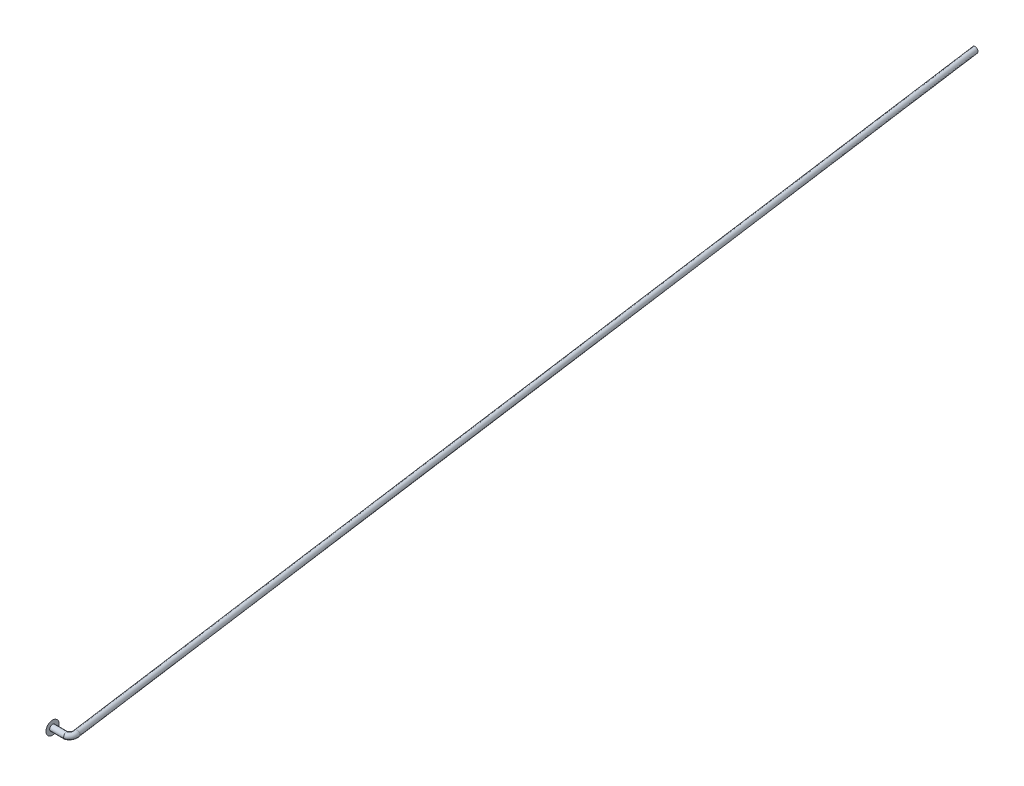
ISO-10303-21;
HEADER;
FILE_DESCRIPTION(('STEP AP214'),'2;1');
FILE_NAME('part.step','',(''),(''),'','','');
FILE_SCHEMA(('AUTOMOTIVE_DESIGN { 1 0 10303 214 1 1 1 1 }'));
ENDSEC;
DATA;
#1=APPLICATION_CONTEXT('core data for automotive mechanical design processes');
#2=APPLICATION_PROTOCOL_DEFINITION('international standard','automotive_design',2000,#1);
#3=PRODUCT_CONTEXT('',#1,'mechanical');
#4=PRODUCT('Part','Part','',(#3));
#5=PRODUCT_RELATED_PRODUCT_CATEGORY('part','',(#4));
#6=PRODUCT_DEFINITION_FORMATION('','',#4);
#7=PRODUCT_DEFINITION_CONTEXT('part definition',#1,'design');
#8=PRODUCT_DEFINITION('design','',#6,#7);
#9=PRODUCT_DEFINITION_SHAPE('','',#8);
#10=(LENGTH_UNIT() NAMED_UNIT(*) SI_UNIT(.MILLI.,.METRE.));
#11=(NAMED_UNIT(*) PLANE_ANGLE_UNIT() SI_UNIT($,.RADIAN.));
#12=(NAMED_UNIT(*) SI_UNIT($,.STERADIAN.) SOLID_ANGLE_UNIT());
#13=UNCERTAINTY_MEASURE_WITH_UNIT(LENGTH_MEASURE(1.E-05),#10,'distance_accuracy_value','');
#14=(GEOMETRIC_REPRESENTATION_CONTEXT(3) GLOBAL_UNCERTAINTY_ASSIGNED_CONTEXT((#13)) GLOBAL_UNIT_ASSIGNED_CONTEXT((#10,
#11,#12)) REPRESENTATION_CONTEXT('',''));
#15=CARTESIAN_POINT('',(0.,0.,0.));
#16=DIRECTION('',(0.,0.,1.));
#17=DIRECTION('',(1.,0.,0.));
#18=AXIS2_PLACEMENT_3D('',#15,#16,#17);
#19=CARTESIAN_POINT('',(-28.3053863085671,-0.00395858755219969,279.551912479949));
#20=DIRECTION('',(0.,0.,1.00000000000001));
#21=DIRECTION('',(0.999999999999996,0.,0.));
#22=AXIS2_PLACEMENT_3D('',#19,#20,#21);
#23=CIRCLE('',#22,0.749999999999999);
#24=DIRECTION('',(-0.135758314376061,0.,-0.990741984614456));
#25=VECTOR('',#24,1.);
#26=SURFACE_OF_LINEAR_EXTRUSION('',#23,#25);
#27=CARTESIAN_POINT('',(-65.6523331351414,-0.00395858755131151,6.9999999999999));
#28=DIRECTION('',(0.,0.,1.00000000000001));
#29=DIRECTION('',(0.999999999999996,0.,0.));
#30=AXIS2_PLACEMENT_3D('',#27,#28,#29);
#31=CIRCLE('',#30,0.749999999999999);
#32=CARTESIAN_POINT('',(-64.9023331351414,-0.00395858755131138,6.9999999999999));
#33=VERTEX_POINT('',#32);
#34=EDGE_CURVE('E54',#33,#33,#31,.T.);
#35=ORIENTED_EDGE('',*,*,#34,.T.);
#36=EDGE_LOOP('',(#35));
#37=FACE_BOUND('',#36,.T.);
#38=CARTESIAN_POINT('',(-27.8664584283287,-0.00395858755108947,277.281759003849));
#39=CARTESIAN_POINT('',(-27.866460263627,0.0377467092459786,277.281759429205));
#40=CARTESIAN_POINT('',(-27.8698417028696,0.0794911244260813,277.282543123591));
#41=CARTESIAN_POINT('',(-27.8832817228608,0.161810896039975,277.285658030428));
#42=CARTESIAN_POINT('',(-27.8933403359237,0.202386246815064,277.287989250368));
#43=CARTESIAN_POINT('',(-27.9198461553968,0.281222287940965,277.294132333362));
#44=CARTESIAN_POINT('',(-27.9362850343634,0.319485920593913,277.297942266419));
#45=CARTESIAN_POINT('',(-27.975069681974,0.392610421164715,277.306931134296));
#46=CARTESIAN_POINT('',(-27.9974028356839,0.427478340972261,277.312107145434));
#47=CARTESIAN_POINT('',(-28.0473279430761,0.49285440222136,277.323677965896));
#48=CARTESIAN_POINT('',(-28.0749068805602,0.523373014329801,277.330069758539));
#49=CARTESIAN_POINT('',(-28.1345358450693,0.579227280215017,277.343889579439));
#50=CARTESIAN_POINT('',(-28.166574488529,0.604575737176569,277.3513149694));
#51=CARTESIAN_POINT('',(-28.2342237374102,0.649421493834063,277.366993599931));
#52=CARTESIAN_POINT('',(-28.2698259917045,0.668932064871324,277.375244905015));
#53=CARTESIAN_POINT('',(-28.3436205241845,0.701599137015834,277.392347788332));
#54=CARTESIAN_POINT('',(-28.3818079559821,0.714767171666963,277.40119824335));
#55=CARTESIAN_POINT('',(-28.4597350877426,0.734417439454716,277.419258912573));
#56=CARTESIAN_POINT('',(-28.4994729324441,0.740907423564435,277.428468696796));
#57=CARTESIAN_POINT('',(-28.5794321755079,0.747042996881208,277.447000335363));
#58=CARTESIAN_POINT('',(-28.6196533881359,0.746691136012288,277.45632214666));
#59=CARTESIAN_POINT('',(-28.6994841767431,0.739159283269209,277.474824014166));
#60=CARTESIAN_POINT('',(-28.7390937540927,0.731979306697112,277.484004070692));
#61=CARTESIAN_POINT('',(-28.8166103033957,0.710995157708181,277.501969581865));
#62=CARTESIAN_POINT('',(-28.85451728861,0.6971910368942,277.510755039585));
#63=CARTESIAN_POINT('',(-28.9275899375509,0.663348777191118,277.527690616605));
#64=CARTESIAN_POINT('',(-28.9627556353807,0.643310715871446,277.535840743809));
#65=CARTESIAN_POINT('',(-29.0293896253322,0.597562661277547,277.551284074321));
#66=CARTESIAN_POINT('',(-29.0608579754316,0.571852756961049,277.558577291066));
#67=CARTESIAN_POINT('',(-29.1192499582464,0.515475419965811,277.572110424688));
#68=CARTESIAN_POINT('',(-29.1461736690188,0.484808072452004,277.578350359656));
#69=CARTESIAN_POINT('',(-29.1947590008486,0.419359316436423,277.589610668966));
#70=CARTESIAN_POINT('',(-29.2164207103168,0.384577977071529,277.594631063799));
#71=CARTESIAN_POINT('',(-29.2539107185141,0.311848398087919,277.603319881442));
#72=CARTESIAN_POINT('',(-29.2697391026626,0.273900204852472,277.60698832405));
#73=CARTESIAN_POINT('',(-29.2951486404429,0.195861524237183,277.6128773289));
#74=CARTESIAN_POINT('',(-29.3047298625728,0.1557710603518,277.615097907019));
#75=CARTESIAN_POINT('',(-29.317396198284,0.0745235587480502,277.618033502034));
#76=CARTESIAN_POINT('',(-29.3204813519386,0.0333665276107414,277.618748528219));
#77=CARTESIAN_POINT('',(-29.3200757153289,-0.0489133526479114,277.618654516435));
#78=CARTESIAN_POINT('',(-29.3165849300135,-0.0900362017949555,277.617845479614));
#79=CARTESIAN_POINT('',(-29.303117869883,-0.17114778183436,277.614724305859));
#80=CARTESIAN_POINT('',(-29.2931415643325,-0.211136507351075,277.612412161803));
#81=CARTESIAN_POINT('',(-29.2669627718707,-0.288906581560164,277.606344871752));
#82=CARTESIAN_POINT('',(-29.2507602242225,-0.326687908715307,277.60258971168));
#83=CARTESIAN_POINT('',(-29.2125528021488,-0.399022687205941,277.593734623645));
#84=CARTESIAN_POINT('',(-29.1905478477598,-0.433576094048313,277.58863467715));
#85=CARTESIAN_POINT('',(-29.1413163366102,-0.49851361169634,277.577224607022));
#86=CARTESIAN_POINT('',(-29.1140896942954,-0.528897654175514,277.570914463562));
#87=CARTESIAN_POINT('',(-29.0551406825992,-0.584660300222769,277.557252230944));
#88=CARTESIAN_POINT('',(-29.0234182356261,-0.610038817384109,277.549900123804));
#89=CARTESIAN_POINT('',(-28.9563322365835,-0.655084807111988,277.534352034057));
#90=CARTESIAN_POINT('',(-28.9209686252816,-0.674752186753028,277.526156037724));
#91=CARTESIAN_POINT('',(-28.8475622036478,-0.707823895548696,277.509143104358));
#92=CARTESIAN_POINT('',(-28.8095193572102,-0.72122814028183,277.500326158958));
#93=CARTESIAN_POINT('',(-28.7317972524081,-0.741394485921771,277.482313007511));
#94=CARTESIAN_POINT('',(-28.6921179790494,-0.748156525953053,277.473116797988));
#95=CARTESIAN_POINT('',(-28.6122161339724,-0.754846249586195,277.454598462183));
#96=CARTESIAN_POINT('',(-28.571993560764,-0.754773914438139,277.445276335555));
#97=CARTESIAN_POINT('',(-28.4921150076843,-0.747796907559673,277.426763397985));
#98=CARTESIAN_POINT('',(-28.452459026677,-0.740892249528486,277.41757258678));
#99=CARTESIAN_POINT('',(-28.3748060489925,-0.720446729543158,277.399575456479));
#100=CARTESIAN_POINT('',(-28.3368090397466,-0.706905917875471,277.39076913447));
#101=CARTESIAN_POINT('',(-28.2635154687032,-0.673570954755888,277.373782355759));
#102=CARTESIAN_POINT('',(-28.2282188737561,-0.653776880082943,277.365601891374));
#103=CARTESIAN_POINT('',(-28.161286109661,-0.608490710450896,277.350089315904));
#104=CARTESIAN_POINT('',(-28.1296498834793,-0.58299870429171,277.342757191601));
#105=CARTESIAN_POINT('',(-28.0708900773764,-0.527025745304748,277.329138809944));
#106=CARTESIAN_POINT('',(-28.0437664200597,-0.496544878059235,277.322852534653));
#107=CARTESIAN_POINT('',(-27.9947546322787,-0.43143125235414,277.311493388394));
#108=CARTESIAN_POINT('',(-27.9728664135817,-0.39679856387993,277.306420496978));
#109=CARTESIAN_POINT('',(-27.9349035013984,-0.32433086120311,277.297622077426));
#110=CARTESIAN_POINT('',(-27.9188287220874,-0.286495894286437,277.2938965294));
#111=CARTESIAN_POINT('',(-27.8930251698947,-0.208964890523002,277.287916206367));
#112=CARTESIAN_POINT('',(-27.8832418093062,-0.169288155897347,277.285648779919));
#113=CARTESIAN_POINT('',(-27.873269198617,-0.108499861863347,277.283337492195));
#114=CARTESIAN_POINT('',(-27.8707278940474,-0.0877680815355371,277.282748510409));
#115=CARTESIAN_POINT('',(-27.867316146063,-0.0460143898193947,277.281957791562));
#116=CARTESIAN_POINT('',(-27.8664575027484,-0.0249914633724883,277.281758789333));
#117=CARTESIAN_POINT('',(-27.8664584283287,-0.00395858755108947,277.281759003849));
#118=B_SPLINE_CURVE_WITH_KNOTS('',3,(#38,#39,#40,#41,#42,#43,#44,#45,#46,#47,#48,#49,#50,#51,
#52,#53,#54,#55,#56,#57,#58,#59,#60,#61,#62,#63,#64,#65,#66,#67,#68,#69,#70,#71,#72,#73,#74,#75,
#76,#77,#78,#79,#80,#81,#82,#83,#84,#85,#86,#87,#88,#89,#90,#91,#92,#93,#94,#95,#96,#97,#98,#99,
#100,#101,#102,#103,#104,#105,#106,#107,#108,#109,#110,#111,#112,#113,#114,#115,#116,#117),
.UNSPECIFIED.,.T.,.F.,(4,2,2,2,2,2,2,2,2,2,2,2,2,2,2,2,2,2,2,2,2,2,2,2,2,2,2,2,2,2,2,2,2,2,2,2,
2,2,2,4),(0.,0.125040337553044,0.250081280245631,0.37495956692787,0.499572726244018,
0.623880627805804,0.747876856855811,0.871589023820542,0.995075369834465,1.11841822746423,
1.24171511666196,1.36501172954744,1.4883073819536,1.61160150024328,1.73489368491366,
1.8581837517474,1.98147174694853,2.10475793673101,2.22804277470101,2.3513268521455,
2.47461083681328,2.59789540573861,2.72118117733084,2.84446864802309,2.9677581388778,
3.09104975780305,3.21434338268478,3.33763866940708,3.46093508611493,3.58423184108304,
3.70752834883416,3.83082392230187,3.95411798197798,4.07741012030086,4.20070014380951,
4.32398808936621,4.44727421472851,4.56947567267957,4.63209858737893,4.69515911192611),.UNSPECIFIED.);
#119=CARTESIAN_POINT('',(-27.8664584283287,-0.00395858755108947,277.281759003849));
#120=VERTEX_POINT('',#119);
#121=EDGE_CURVE('E12',#120,#120,#118,.T.);
#122=ORIENTED_EDGE('',*,*,#121,.F.);
#123=EDGE_LOOP('',(#122));
#124=FACE_BOUND('',#123,.T.);
#125=ADVANCED_FACE('F42',(#37,#124),#26,.F.);
#126=CARTESIAN_POINT('',(-65.6523331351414,-0.00395858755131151,6.9999999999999));
#127=DIRECTION('',(0.,0.,1.00000000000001));
#128=DIRECTION('',(0.999999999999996,0.,0.));
#129=AXIS2_PLACEMENT_3D('',#126,#127,#128);
#130=PLANE('',#129);
#131=ORIENTED_EDGE('',*,*,#34,.F.);
#132=EDGE_LOOP('',(#131));
#133=FACE_BOUND('',#132,.T.);
#134=ADVANCED_FACE('F89',(#133),#130,.F.);
#135=CARTESIAN_POINT('',(-27.866458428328,-0.00399458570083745,277.28175900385));
#136=CARTESIAN_POINT('',(-27.8253418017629,-0.00399458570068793,277.40612119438));
#137=CARTESIAN_POINT('',(-27.7809592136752,-0.00399458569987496,277.660833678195));
#138=CARTESIAN_POINT('',(-27.7711737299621,-0.00399458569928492,278.150006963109));
#139=CARTESIAN_POINT('',(-27.8698626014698,-0.0039945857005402,278.626435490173));
#140=CARTESIAN_POINT('',(-28.0878911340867,-0.00399458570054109,279.109120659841));
#141=CARTESIAN_POINT('',(-28.4232703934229,-0.0039945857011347,279.511665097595));
#142=CARTESIAN_POINT('',(-28.7568865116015,-0.00399458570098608,279.805173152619));
#143=CARTESIAN_POINT('',(-29.1759832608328,-0.0039945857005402,280.000852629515));
#144=CARTESIAN_POINT('',(-29.3680957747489,-0.00399458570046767,280.0713568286));
#145=CARTESIAN_POINT('',(-27.866458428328,0.0377215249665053,277.28175900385));
#146=CARTESIAN_POINT('',(-27.8253417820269,0.0377215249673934,277.406121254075));
#147=CARTESIAN_POINT('',(-27.7809592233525,0.0377215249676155,277.66083364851));
#148=CARTESIAN_POINT('',(-27.7711737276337,0.0377215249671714,278.150006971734));
#149=CARTESIAN_POINT('',(-27.8698626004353,0.0377215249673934,278.626435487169));
#150=CARTESIAN_POINT('',(-28.0878911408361,0.0377215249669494,279.109120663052));
#151=CARTESIAN_POINT('',(-28.4232703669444,0.0377215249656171,279.511665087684));
#152=CARTESIAN_POINT('',(-28.756886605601,0.0377215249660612,279.805173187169));
#153=CARTESIAN_POINT('',(-29.1759830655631,0.0377215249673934,280.000852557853));
#154=CARTESIAN_POINT('',(-29.3680957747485,0.0377215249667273,280.0713568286));
#155=CARTESIAN_POINT('',(-27.8698489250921,0.0795443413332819,277.28254479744));
#156=CARTESIAN_POINT('',(-27.8287758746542,0.0795443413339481,277.40677518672));
#157=CARTESIAN_POINT('',(-27.7844010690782,0.0795443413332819,277.661266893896));
#158=CARTESIAN_POINT('',(-27.7746553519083,0.079544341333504,278.149647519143));
#159=CARTESIAN_POINT('',(-27.8731899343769,0.0795443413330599,278.625378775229));
#160=CARTESIAN_POINT('',(-28.0908699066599,0.0795443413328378,279.107260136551));
#161=CARTESIAN_POINT('',(-28.4256865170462,0.079544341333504,279.50917912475));
#162=CARTESIAN_POINT('',(-28.7589918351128,0.0795443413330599,279.802322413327));
#163=CARTESIAN_POINT('',(-29.177029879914,0.0795443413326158,279.997544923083));
#164=CARTESIAN_POINT('',(-29.3687116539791,0.0795443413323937,280.067891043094));
#165=CARTESIAN_POINT('',(-27.8832745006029,0.161757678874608,277.28565635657));
#166=CARTESIAN_POINT('',(-27.8423746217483,0.161757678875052,277.409362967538));
#167=CARTESIAN_POINT('',(-27.7980297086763,0.161757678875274,277.662983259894));
#168=CARTESIAN_POINT('',(-27.7884418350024,0.161757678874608,278.148223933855));
#169=CARTESIAN_POINT('',(-27.8863654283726,0.16175767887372,278.62119452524));
#170=CARTESIAN_POINT('',(-28.102664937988,0.161757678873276,279.099892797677));
#171=CARTESIAN_POINT('',(-28.4352546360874,0.16175767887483,279.499335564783));
#172=CARTESIAN_POINT('',(-28.7673254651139,0.161757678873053,279.791033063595));
#173=CARTESIAN_POINT('',(-29.1811803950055,0.161757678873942,279.984449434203));
#174=CARTESIAN_POINT('',(-29.3711503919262,0.161757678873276,280.054167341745));
#175=CARTESIAN_POINT('',(-27.8933556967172,0.20242988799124,277.28799281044));
#176=CARTESIAN_POINT('',(-27.85258539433,0.202429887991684,277.411307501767));
#177=CARTESIAN_POINT('',(-27.8082636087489,0.202429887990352,277.66427138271));
#178=CARTESIAN_POINT('',(-27.7987939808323,0.202429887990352,278.147155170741));
#179=CARTESIAN_POINT('',(-27.8962588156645,0.202429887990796,278.618052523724));
#180=CARTESIAN_POINT('',(-28.111521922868,0.202429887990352,279.094360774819));
#181=CARTESIAN_POINT('',(-28.442438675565,0.202429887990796,279.491943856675));
#182=CARTESIAN_POINT('',(-28.7735853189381,0.202429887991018,279.782556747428));
#183=CARTESIAN_POINT('',(-29.1842924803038,0.20242988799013,279.974614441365));
#184=CARTESIAN_POINT('',(-29.3729816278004,0.20242988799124,280.04386228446));
#185=CARTESIAN_POINT('',(-27.919830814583,0.281178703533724,277.294128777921));
#186=CARTESIAN_POINT('',(-27.8794019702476,0.28117870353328,277.416410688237));
#187=CARTESIAN_POINT('',(-27.8351391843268,0.281178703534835,277.667655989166));
#188=CARTESIAN_POINT('',(-27.8259808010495,0.28117870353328,278.144347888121));
#189=CARTESIAN_POINT('',(-27.9222407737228,0.281178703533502,278.60980121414));
#190=CARTESIAN_POINT('',(-28.1347816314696,0.28117870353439,279.07983245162));
#191=CARTESIAN_POINT('',(-28.4613068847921,0.281178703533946,279.472532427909));
#192=CARTESIAN_POINT('',(-28.7900192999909,0.28117870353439,279.76029429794));
#193=CARTESIAN_POINT('',(-29.192476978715,0.281178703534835,279.948790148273));
#194=CARTESIAN_POINT('',(-29.3777907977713,0.28117870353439,280.016799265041));
#195=CARTESIAN_POINT('',(-27.9363072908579,0.319528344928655,277.297947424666));
#196=CARTESIAN_POINT('',(-27.8960902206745,0.319528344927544,277.419588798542));
#197=CARTESIAN_POINT('',(-27.8518652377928,0.319528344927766,277.669761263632));
#198=CARTESIAN_POINT('',(-27.8429001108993,0.319528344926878,278.142601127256));
#199=CARTESIAN_POINT('',(-27.9384102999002,0.319528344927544,278.604665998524));
#200=CARTESIAN_POINT('',(-28.1492572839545,0.319528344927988,279.070791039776));
#201=CARTESIAN_POINT('',(-28.4730483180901,0.31952834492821,279.460451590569));
#202=CARTESIAN_POINT('',(-28.8002502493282,0.319528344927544,279.74644079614));
#203=CARTESIAN_POINT('',(-29.1975633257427,0.319528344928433,279.932716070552));
#204=CARTESIAN_POINT('',(-29.3807837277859,0.319528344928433,279.999956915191));
#205=CARTESIAN_POINT('',(-27.9750474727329,0.392568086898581,277.306925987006));
#206=CARTESIAN_POINT('',(-27.9353300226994,0.392568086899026,277.427056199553));
#207=CARTESIAN_POINT('',(-27.8911914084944,0.39256808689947,277.674713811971));
#208=CARTESIAN_POINT('',(-27.8826817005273,0.392568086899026,278.138493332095));
#209=CARTESIAN_POINT('',(-27.9764288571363,0.39256808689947,278.592592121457));
#210=CARTESIAN_POINT('',(-28.1832924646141,0.392568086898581,279.04953221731));
#211=CARTESIAN_POINT('',(-28.500657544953,0.392568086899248,279.432047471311));
#212=CARTESIAN_POINT('',(-28.8242976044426,0.392568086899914,279.713864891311));
#213=CARTESIAN_POINT('',(-29.2095393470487,0.392568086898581,279.894928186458));
#214=CARTESIAN_POINT('',(-29.3878208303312,0.392568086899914,279.960356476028));
#215=CARTESIAN_POINT('',(-27.9974315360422,0.427515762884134,277.312113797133));
#216=CARTESIAN_POINT('',(-27.9580017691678,0.427515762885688,277.431373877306));
#217=CARTESIAN_POINT('',(-27.9139145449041,0.427515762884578,277.677573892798));
#218=CARTESIAN_POINT('',(-27.9056673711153,0.427515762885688,278.136120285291));
#219=CARTESIAN_POINT('',(-27.9983959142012,0.427515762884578,278.58561568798));
#220=CARTESIAN_POINT('',(-28.202958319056,0.427515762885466,279.037249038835));
#221=CARTESIAN_POINT('',(-28.5166088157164,0.427515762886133,279.415635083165));
#222=CARTESIAN_POINT('',(-28.8381968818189,0.427515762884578,279.695044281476));
#223=CARTESIAN_POINT('',(-29.2164492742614,0.427515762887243,279.873090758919));
#224=CARTESIAN_POINT('',(-29.3918868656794,0.427515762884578,279.937475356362));
#225=CARTESIAN_POINT('',(-28.0472993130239,0.492817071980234,277.323671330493));
#226=CARTESIAN_POINT('',(-28.0085126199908,0.492817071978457,277.440986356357));
#227=CARTESIAN_POINT('',(-27.9645366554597,0.492817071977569,277.683948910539));
#228=CARTESIAN_POINT('',(-27.9568756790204,0.492817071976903,278.130832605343));
#229=CARTESIAN_POINT('',(-28.0473347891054,0.492817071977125,278.570073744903));
#230=CARTESIAN_POINT('',(-28.2467696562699,0.492817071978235,279.009883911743));
#231=CARTESIAN_POINT('',(-28.5521483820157,0.492817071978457,279.379072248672));
#232=CARTESIAN_POINT('',(-28.8691516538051,0.492817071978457,279.653111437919));
#233=CARTESIAN_POINT('',(-29.2318649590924,0.492817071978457,279.824448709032));
#234=CARTESIAN_POINT('',(-29.4009452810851,0.492817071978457,279.886500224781));
#235=CARTESIAN_POINT('',(-28.0749411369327,0.523405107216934,277.330077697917));
#236=CARTESIAN_POINT('',(-28.0365096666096,0.523405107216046,277.4463183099));
#237=CARTESIAN_POINT('',(-27.9925972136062,0.523405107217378,277.687480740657));
#238=CARTESIAN_POINT('',(-27.985260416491,0.52340510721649,278.127902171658));
#239=CARTESIAN_POINT('',(-28.0744616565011,0.523405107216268,278.561458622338));
#240=CARTESIAN_POINT('',(-28.2710548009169,0.523405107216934,278.994715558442));
#241=CARTESIAN_POINT('',(-28.5718464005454,0.523405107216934,279.35880476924));
#242=CARTESIAN_POINT('',(-28.886315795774,0.523405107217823,279.629870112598));
#243=CARTESIAN_POINT('',(-29.2403977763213,0.52340510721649,279.797481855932));
#244=CARTESIAN_POINT('',(-29.4059663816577,0.523405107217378,279.858244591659));
#245=CARTESIAN_POINT('',(-28.1345016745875,0.579195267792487,277.343881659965));
#246=CARTESIAN_POINT('',(-28.0968381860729,0.579195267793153,277.457799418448));
#247=CARTESIAN_POINT('',(-28.0530587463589,0.579195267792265,277.69509473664));
#248=CARTESIAN_POINT('',(-28.0464220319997,0.579195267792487,278.121586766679));
#249=CARTESIAN_POINT('',(-28.1329127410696,0.579195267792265,278.542895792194));
#250=CARTESIAN_POINT('',(-28.3233817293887,0.579195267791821,278.962031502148));
#251=CARTESIAN_POINT('',(-28.6142937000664,0.579195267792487,279.315135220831));
#252=CARTESIAN_POINT('',(-28.9232874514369,0.579195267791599,279.579786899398));
#253=CARTESIAN_POINT('',(-29.2588093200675,0.579195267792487,279.739385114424));
#254=CARTESIAN_POINT('',(-29.4167854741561,0.579195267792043,279.797361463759));
#255=CARTESIAN_POINT('',(-28.1666133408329,0.604601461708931,277.351323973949));
#256=CARTESIAN_POINT('',(-28.1293624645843,0.604601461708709,277.463993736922));
#257=CARTESIAN_POINT('',(-28.0856568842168,0.604601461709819,277.699197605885));
#258=CARTESIAN_POINT('',(-28.079396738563,0.604601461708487,278.118182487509));
#259=CARTESIAN_POINT('',(-28.1644261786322,0.604601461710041,278.532887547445));
#260=CARTESIAN_POINT('',(-28.3515939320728,0.604601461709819,278.944410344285));
#261=CARTESIAN_POINT('',(-28.6371769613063,0.604601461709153,279.291590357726));
#262=CARTESIAN_POINT('',(-28.9432272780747,0.604601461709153,279.552787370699));
#263=CARTESIAN_POINT('',(-29.2687216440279,0.604601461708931,279.708057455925));
#264=CARTESIAN_POINT('',(-29.4226185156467,0.604601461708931,279.764536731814));
#265=CARTESIAN_POINT('',(-28.2341849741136,0.649395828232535,277.366984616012));
#266=CARTESIAN_POINT('',(-28.1978052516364,0.649395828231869,277.477019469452));
#267=CARTESIAN_POINT('',(-28.1542507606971,0.649395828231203,277.707835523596));
#268=CARTESIAN_POINT('',(-28.148784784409,0.649395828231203,278.111017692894));
#269=CARTESIAN_POINT('',(-28.230739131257,0.649395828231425,278.511827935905));
#270=CARTESIAN_POINT('',(-28.4109590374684,0.649395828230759,278.907330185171));
#271=CARTESIAN_POINT('',(-28.6853334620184,0.649395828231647,279.242047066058));
#272=CARTESIAN_POINT('',(-28.9851721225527,0.649395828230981,279.495967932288));
#273=CARTESIAN_POINT('',(-29.2896088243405,0.649395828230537,279.642146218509));
#274=CARTESIAN_POINT('',(-29.4348928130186,0.649395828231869,279.695464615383));
#275=CARTESIAN_POINT('',(-28.2698683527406,0.668950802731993,277.37525472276));
#276=CARTESIAN_POINT('',(-28.2339470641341,0.668950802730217,277.483902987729));
#277=CARTESIAN_POINT('',(-28.1904747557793,0.668950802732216,277.712394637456));
#278=CARTESIAN_POINT('',(-28.1854271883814,0.668950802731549,278.107234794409));
#279=CARTESIAN_POINT('',(-28.2657577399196,0.668950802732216,278.500706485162));
#280=CARTESIAN_POINT('',(-28.4423092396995,0.668950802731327,278.887749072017));
#281=CARTESIAN_POINT('',(-28.7107619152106,0.668950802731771,279.215883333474));
#282=CARTESIAN_POINT('',(-29.0073300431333,0.668950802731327,279.465965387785));
#283=CARTESIAN_POINT('',(-29.3006231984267,0.668950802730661,279.607333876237));
#284=CARTESIAN_POINT('',(-29.4413746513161,0.668950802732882,279.658988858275));
#285=CARTESIAN_POINT('',(-28.3435782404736,0.701580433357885,277.392337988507));
#286=CARTESIAN_POINT('',(-28.3086070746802,0.70158043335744,277.498112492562));
#287=CARTESIAN_POINT('',(-28.2652998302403,0.701580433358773,277.721816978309));
#288=CARTESIAN_POINT('',(-28.2611184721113,0.701580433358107,278.099419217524));
#289=CARTESIAN_POINT('',(-28.3380946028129,0.701580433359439,278.477733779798));
#290=CARTESIAN_POINT('',(-28.5070671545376,0.701580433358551,278.847300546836));
#291=CARTESIAN_POINT('',(-28.7632928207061,0.701580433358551,279.161839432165));
#292=CARTESIAN_POINT('',(-29.0530857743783,0.701580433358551,279.403984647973));
#293=CARTESIAN_POINT('',(-29.3234065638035,0.701580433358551,279.535434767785));
#294=CARTESIAN_POINT('',(-29.4547639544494,0.701580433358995,279.583642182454));
#295=CARTESIAN_POINT('',(-28.3818526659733,0.714778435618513,277.401208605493));
#296=CARTESIAN_POINT('',(-28.3473731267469,0.714778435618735,277.505496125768));
#297=CARTESIAN_POINT('',(-28.3041541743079,0.714778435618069,277.726706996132));
#298=CARTESIAN_POINT('',(-28.3004215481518,0.714778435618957,278.095361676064));
#299=CARTESIAN_POINT('',(-28.3756559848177,0.71477843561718,278.465804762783));
#300=CARTESIAN_POINT('',(-28.5406937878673,0.714778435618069,278.826297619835));
#301=CARTESIAN_POINT('',(-28.7905675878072,0.714778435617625,279.133775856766));
#302=CARTESIAN_POINT('',(-29.0768529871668,0.714778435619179,279.371803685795));
#303=CARTESIAN_POINT('',(-29.3352199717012,0.714778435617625,279.49809435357));
#304=CARTESIAN_POINT('',(-29.4617164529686,0.714778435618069,279.544517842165));
#305=CARTESIAN_POINT('',(-28.4596904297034,0.734406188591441,277.419248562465));
#306=CARTESIAN_POINT('',(-28.426214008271,0.734406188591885,277.520502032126));
#307=CARTESIAN_POINT('',(-28.3831696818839,0.734406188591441,277.736656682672));
#308=CARTESIAN_POINT('',(-28.3803516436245,0.734406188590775,278.087108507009));
#309=CARTESIAN_POINT('',(-28.4520438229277,0.734406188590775,278.441545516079));
#310=CARTESIAN_POINT('',(-28.6090783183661,0.734406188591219,278.78358394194));
#311=CARTESIAN_POINT('',(-28.8460400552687,0.734406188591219,279.07670531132));
#312=CARTESIAN_POINT('',(-29.1251720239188,0.734406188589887,279.306352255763));
#313=CARTESIAN_POINT('',(-29.3592773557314,0.734406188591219,279.422168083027));
#314=CARTESIAN_POINT('',(-29.4758555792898,0.734406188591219,279.464951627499));
#315=CARTESIAN_POINT('',(-28.4995187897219,0.74091093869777,277.428479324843));
#316=CARTESIAN_POINT('',(-28.4665538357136,0.740910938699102,277.52818579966));
#317=CARTESIAN_POINT('',(-28.423601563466,0.740910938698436,277.741745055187));
#318=CARTESIAN_POINT('',(-28.4212504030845,0.740910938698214,278.082886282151));
#319=CARTESIAN_POINT('',(-28.4911301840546,0.740910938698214,278.429132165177));
#320=CARTESIAN_POINT('',(-28.6440702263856,0.740910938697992,278.761728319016));
#321=CARTESIAN_POINT('',(-28.874422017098,0.740910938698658,279.047502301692));
#322=CARTESIAN_POINT('',(-29.1499047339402,0.740910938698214,279.272864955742));
#323=CARTESIAN_POINT('',(-29.3715692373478,0.740910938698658,279.383311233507));
#324=CARTESIAN_POINT('',(-29.4830903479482,0.740910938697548,279.424238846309));
#325=CARTESIAN_POINT('',(-28.5793863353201,0.747039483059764,277.44698971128));
#326=CARTESIAN_POINT('',(-28.547450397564,0.747039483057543,277.543583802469));
#327=CARTESIAN_POINT('',(-28.5046776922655,0.747039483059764,277.751953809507));
#328=CARTESIAN_POINT('',(-28.5032648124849,0.74703948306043,278.074418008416));
#329=CARTESIAN_POINT('',(-28.5695099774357,0.747039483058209,278.404240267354));
#330=CARTESIAN_POINT('',(-28.7142381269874,0.747039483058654,278.717900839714));
#331=CARTESIAN_POINT('',(-28.9313406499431,0.747039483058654,278.988943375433));
#332=CARTESIAN_POINT('',(-29.1994851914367,0.747039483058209,279.20570725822));
#333=CARTESIAN_POINT('',(-29.3962510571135,0.747039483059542,279.305403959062));
#334=CARTESIAN_POINT('',(-29.497598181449,0.747039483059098,279.342597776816));
#335=CARTESIAN_POINT('',(-28.6196991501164,0.746686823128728,277.45633275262));
#336=CARTESIAN_POINT('',(-28.588280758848,0.746686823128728,277.55136146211));
#337=CARTESIAN_POINT('',(-28.5456014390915,0.746686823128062,277.757103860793));
#338=CARTESIAN_POINT('',(-28.5446610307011,0.746686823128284,278.070144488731));
#339=CARTESIAN_POINT('',(-28.6090717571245,0.746686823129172,278.391675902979));
#340=CARTESIAN_POINT('',(-28.7496557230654,0.746686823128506,278.695779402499));
#341=CARTESIAN_POINT('',(-28.9600675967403,0.74668682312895,278.959385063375));
#342=CARTESIAN_POINT('',(-29.2245195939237,0.746686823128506,279.17181294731));
#343=CARTESIAN_POINT('',(-29.4086906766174,0.74668682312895,279.26607382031));
#344=CARTESIAN_POINT('',(-29.5049209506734,0.746686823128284,279.301389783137));
#345=CARTESIAN_POINT('',(-28.6994384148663,0.73916359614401,277.47481340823));
#346=CARTESIAN_POINT('',(-28.6690470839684,0.739163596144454,277.566735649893));
#347=CARTESIAN_POINT('',(-28.6265474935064,0.7391635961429,277.767295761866));
#348=CARTESIAN_POINT('',(-28.6265436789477,0.739163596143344,278.061689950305));
#349=CARTESIAN_POINT('',(-28.6873256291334,0.739163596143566,278.36682393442));
#350=CARTESIAN_POINT('',(-28.8197110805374,0.739163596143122,278.652022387));
#351=CARTESIAN_POINT('',(-29.0168941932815,0.739163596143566,278.900919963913));
#352=CARTESIAN_POINT('',(-29.2740225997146,0.739163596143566,279.104763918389));
#353=CARTESIAN_POINT('',(-29.4333283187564,0.73916359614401,279.188290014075));
#354=CARTESIAN_POINT('',(-29.5194054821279,0.739163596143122,279.219879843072));
#355=CARTESIAN_POINT('',(-28.739138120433,0.731967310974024,277.484014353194));
#356=CARTESIAN_POINT('',(-28.7092563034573,0.731967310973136,277.574395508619));
#357=CARTESIAN_POINT('',(-28.6668489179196,0.731967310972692,277.772367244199));
#358=CARTESIAN_POINT('',(-28.6673102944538,0.731967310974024,278.057481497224));
#359=CARTESIAN_POINT('',(-28.7262857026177,0.731967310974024,278.354450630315));
#360=CARTESIAN_POINT('',(-28.8545901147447,0.731967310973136,278.630237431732));
#361=CARTESIAN_POINT('',(-29.0451838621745,0.731967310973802,278.87181105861));
#362=CARTESIAN_POINT('',(-29.2986775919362,0.731967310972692,279.071385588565));
#363=CARTESIAN_POINT('',(-29.4455759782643,0.731967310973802,279.149557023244));
#364=CARTESIAN_POINT('',(-29.5266168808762,0.731967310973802,279.179298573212));
#365=CARTESIAN_POINT('',(-28.8165659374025,0.711007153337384,277.501959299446));
#366=CARTESIAN_POINT('',(-28.7876810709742,0.711007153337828,277.589325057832));
#367=CARTESIAN_POINT('',(-28.7454487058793,0.711007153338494,277.78226319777));
#368=CARTESIAN_POINT('',(-28.7468193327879,0.711007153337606,278.049272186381));
#369=CARTESIAN_POINT('',(-28.8022711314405,0.711007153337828,278.33031899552));
#370=CARTESIAN_POINT('',(-28.9226149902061,0.711007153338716,278.587748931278));
#371=CARTESIAN_POINT('',(-29.1003622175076,0.71100715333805,278.815040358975));
#372=CARTESIAN_POINT('',(-29.3467490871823,0.711007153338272,279.006281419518));
#373=CARTESIAN_POINT('',(-29.4694922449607,0.711007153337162,279.074025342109));
#374=CARTESIAN_POINT('',(-29.5406815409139,0.711007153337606,279.100151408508));
#375=CARTESIAN_POINT('',(-28.8545589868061,0.697171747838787,277.510764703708));
#376=CARTESIAN_POINT('',(-28.8261615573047,0.697171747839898,277.596656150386));
#377=CARTESIAN_POINT('',(-28.7840176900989,0.697171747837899,277.78711639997));
#378=CARTESIAN_POINT('',(-28.7858334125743,0.697171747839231,278.045244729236));
#379=CARTESIAN_POINT('',(-28.8395563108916,0.697171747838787,278.318477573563));
#380=CARTESIAN_POINT('',(-28.9559947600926,0.697171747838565,278.56690055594));
#381=CARTESIAN_POINT('',(-29.1274351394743,0.697171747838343,278.787182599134));
#382=CARTESIAN_POINT('',(-29.3703463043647,0.697171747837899,278.974338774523));
#383=CARTESIAN_POINT('',(-29.4812089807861,0.697171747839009,279.036955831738));
#384=CARTESIAN_POINT('',(-29.5475829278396,0.697171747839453,279.0613146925));
#385=CARTESIAN_POINT('',(-28.9275482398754,0.663368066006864,277.527680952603));
#386=CARTESIAN_POINT('',(-28.9000902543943,0.663368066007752,277.610730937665));
#387=CARTESIAN_POINT('',(-28.8581119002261,0.66336806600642,277.796444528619));
#388=CARTESIAN_POINT('',(-28.8607845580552,0.663368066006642,278.037506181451));
#389=CARTESIAN_POINT('',(-28.9111857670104,0.663368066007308,278.29572920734));
#390=CARTESIAN_POINT('',(-29.0201205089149,0.663368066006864,278.526847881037));
#391=CARTESIAN_POINT('',(-29.1794488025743,0.663368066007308,278.73366570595));
#392=CARTESIAN_POINT('',(-29.4156677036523,0.663368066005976,278.912968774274));
#393=CARTESIAN_POINT('',(-29.5037425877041,0.66336806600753,278.965749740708));
#394=CARTESIAN_POINT('',(-29.5608413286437,0.663368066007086,278.986704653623));
#395=CARTESIAN_POINT('',(-28.9627935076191,0.64328474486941,277.535849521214));
#396=CARTESIAN_POINT('',(-28.9357875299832,0.643284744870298,277.617532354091));
#397=CARTESIAN_POINT('',(-28.8938915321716,0.643284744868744,277.8009464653));
#398=CARTESIAN_POINT('',(-28.8969770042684,0.643284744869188,278.033770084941));
#399=CARTESIAN_POINT('',(-28.9457743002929,0.643284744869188,278.284744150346));
#400=CARTESIAN_POINT('',(-29.0510864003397,0.643284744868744,278.507507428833));
#401=CARTESIAN_POINT('',(-29.20456274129,0.643284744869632,278.707822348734));
#402=CARTESIAN_POINT('',(-29.4375617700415,0.64328474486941,278.883337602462));
#403=CARTESIAN_POINT('',(-29.5146047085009,0.643284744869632,278.93135856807));
#404=CARTESIAN_POINT('',(-29.5672435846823,0.643284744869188,278.950676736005));
#405=CARTESIAN_POINT('',(-29.0293517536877,0.597588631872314,277.551275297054));
#406=CARTESIAN_POINT('',(-29.0032020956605,0.59758863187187,277.630368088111));
#407=CARTESIAN_POINT('',(-28.9614575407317,0.597588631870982,277.809452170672));
#408=CARTESIAN_POINT('',(-28.9653242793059,0.597588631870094,278.026713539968));
#409=CARTESIAN_POINT('',(-29.0110923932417,0.597588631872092,278.264000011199));
#410=CARTESIAN_POINT('',(-29.109562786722,0.597588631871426,278.470984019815));
#411=CARTESIAN_POINT('',(-29.2519908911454,0.597588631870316,278.659019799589));
#412=CARTESIAN_POINT('',(-29.4788993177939,0.597588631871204,278.827378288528));
#413=CARTESIAN_POINT('',(-29.5351334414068,0.597588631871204,278.866419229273));
#414=CARTESIAN_POINT('',(-29.5793338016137,0.59758863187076,278.882640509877));
#415=CARTESIAN_POINT('',(-29.0608910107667,0.571820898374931,277.558584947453));
#416=CARTESIAN_POINT('',(-29.0351456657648,0.571820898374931,277.636454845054));
#417=CARTESIAN_POINT('',(-28.9934750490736,0.571820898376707,277.813480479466));
#418=CARTESIAN_POINT('',(-28.9977111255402,0.571820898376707,278.023370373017));
#419=CARTESIAN_POINT('',(-29.0420438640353,0.571820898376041,278.254169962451));
#420=CARTESIAN_POINT('',(-29.1372730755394,0.571820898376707,278.453677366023));
#421=CARTESIAN_POINT('',(-29.2744624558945,0.571820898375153,278.635893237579));
#422=CARTESIAN_POINT('',(-29.4984971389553,0.571820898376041,278.800864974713));
#423=CARTESIAN_POINT('',(-29.5448411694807,0.571820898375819,278.835639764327));
#424=CARTESIAN_POINT('',(-29.5850628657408,0.571820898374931,278.850400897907));
#425=CARTESIAN_POINT('',(-29.1192169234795,0.515507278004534,277.572102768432));
#426=CARTESIAN_POINT('',(-29.0942216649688,0.515507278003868,277.647703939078));
#427=CARTESIAN_POINT('',(-29.0526842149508,0.515507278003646,277.820933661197));
#428=CARTESIAN_POINT('',(-29.0576048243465,0.51550727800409,278.017186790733));
#429=CARTESIAN_POINT('',(-29.0992827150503,0.515507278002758,278.235991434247));
#430=CARTESIAN_POINT('',(-29.1885179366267,0.515507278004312,278.421671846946));
#431=CARTESIAN_POINT('',(-29.3160198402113,0.515507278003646,278.593125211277));
#432=CARTESIAN_POINT('',(-29.5347379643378,0.515507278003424,278.751832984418));
#433=CARTESIAN_POINT('',(-29.5627972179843,0.515507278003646,278.778720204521));
#434=CARTESIAN_POINT('',(-29.5956576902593,0.51550727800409,278.790779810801));
#435=CARTESIAN_POINT('',(-29.1462010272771,0.484771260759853,277.578356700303));
#436=CARTESIAN_POINT('',(-29.1215515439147,0.484771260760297,277.652912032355));
#437=CARTESIAN_POINT('',(-29.0800775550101,0.484771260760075,277.824379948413));
#438=CARTESIAN_POINT('',(-29.0853141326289,0.484771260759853,278.014326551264));
#439=CARTESIAN_POINT('',(-29.1257637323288,0.484771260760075,278.227581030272));
#440=CARTESIAN_POINT('',(-29.2122268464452,0.484771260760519,278.406865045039));
#441=CARTESIAN_POINT('',(-29.3352429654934,0.484771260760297,278.573337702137));
#442=CARTESIAN_POINT('',(-29.5515156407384,0.484771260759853,278.729152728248));
#443=CARTESIAN_POINT('',(-29.5710814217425,0.484771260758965,278.75237828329));
#444=CARTESIAN_POINT('',(-29.6005593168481,0.484771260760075,278.763196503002));
#445=CARTESIAN_POINT('',(-29.1947316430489,0.419396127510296,277.589604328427));
#446=CARTESIAN_POINT('',(-29.1707060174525,0.419396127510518,277.662272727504));
#447=CARTESIAN_POINT('',(-29.1293431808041,0.419396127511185,277.830581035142));
#448=CARTESIAN_POINT('',(-29.1351493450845,0.419396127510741,278.009181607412));
#449=CARTESIAN_POINT('',(-29.1733893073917,0.419396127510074,278.212455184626));
#450=CARTESIAN_POINT('',(-29.2548677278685,0.419396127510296,278.380235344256));
#451=CARTESIAN_POINT('',(-29.3698130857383,0.419396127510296,278.537749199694));
#452=CARTESIAN_POINT('',(-29.5816988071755,0.419396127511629,278.688365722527));
#453=CARTESIAN_POINT('',(-29.5859624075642,0.419396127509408,278.704995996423));
#454=CARTESIAN_POINT('',(-29.6093748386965,0.419396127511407,278.713588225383));
#455=CARTESIAN_POINT('',(-29.2164417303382,0.384537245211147,277.594635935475));
#456=CARTESIAN_POINT('',(-29.1926941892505,0.384537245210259,277.666463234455));
#457=CARTESIAN_POINT('',(-29.1513825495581,0.384537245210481,277.83335357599));
#458=CARTESIAN_POINT('',(-29.1574429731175,0.384537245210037,278.006880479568));
#459=CARTESIAN_POINT('',(-29.1946942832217,0.384537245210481,278.20568844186));
#460=CARTESIAN_POINT('',(-29.2739441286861,0.384537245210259,278.36832302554));
#461=CARTESIAN_POINT('',(-29.3852738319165,0.384537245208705,278.521827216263));
#462=CARTESIAN_POINT('',(-29.5952158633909,0.384537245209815,278.670125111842));
#463=CARTESIAN_POINT('',(-29.5925889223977,0.384537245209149,278.683788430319));
#464=CARTESIAN_POINT('',(-29.6133184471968,0.384537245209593,278.691396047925));
#465=CARTESIAN_POINT('',(-29.253889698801,0.311889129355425,277.603315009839));
#466=CARTESIAN_POINT('',(-29.2306233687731,0.311889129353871,277.673686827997));
#467=CARTESIAN_POINT('',(-29.1893977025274,0.311889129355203,277.83813826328));
#468=CARTESIAN_POINT('',(-29.1958978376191,0.311889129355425,278.002910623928));
#469=CARTESIAN_POINT('',(-29.231442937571,0.311889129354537,278.194016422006));
#470=CARTESIAN_POINT('',(-29.3068510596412,0.311889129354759,278.34777595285));
#471=CARTESIAN_POINT('',(-29.4119353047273,0.311889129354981,278.494360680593));
#472=CARTESIAN_POINT('',(-29.6185561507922,0.311889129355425,278.638670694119));
#473=CARTESIAN_POINT('',(-29.603968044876,0.311889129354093,278.647188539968));
#474=CARTESIAN_POINT('',(-29.6201208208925,0.311889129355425,278.653116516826));
#475=CARTESIAN_POINT('',(-29.2697533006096,0.273856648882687,277.606991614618));
#476=CARTESIAN_POINT('',(-29.24669009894,0.273856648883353,277.67674904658));
#477=CARTESIAN_POINT('',(-29.2055019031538,0.273856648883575,277.840164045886));
#478=CARTESIAN_POINT('',(-29.2121879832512,0.273856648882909,278.001229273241));
#479=CARTESIAN_POINT('',(-29.2470099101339,0.273856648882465,278.189071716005));
#480=CARTESIAN_POINT('',(-29.3207925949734,0.273856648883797,278.339072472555));
#481=CARTESIAN_POINT('',(-29.4232234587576,0.273856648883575,278.482723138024));
#482=CARTESIAN_POINT('',(-29.6284651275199,0.273856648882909,278.625354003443));
#483=CARTESIAN_POINT('',(-29.6087435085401,0.273856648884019,278.631667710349));
#484=CARTESIAN_POINT('',(-29.6230024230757,0.273856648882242,278.63690065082));
#485=CARTESIAN_POINT('',(-29.2951344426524,0.195905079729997,277.61287403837));
#486=CARTESIAN_POINT('',(-29.2723972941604,0.19590507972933,277.68164528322));
#487=CARTESIAN_POINT('',(-29.2312674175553,0.195905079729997,277.843406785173));
#488=CARTESIAN_POINT('',(-29.2382519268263,0.195905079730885,277.99853879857));
#489=CARTESIAN_POINT('',(-29.2719156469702,0.195905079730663,278.181160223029));
#490=CARTESIAN_POINT('',(-29.3431014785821,0.195905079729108,278.325148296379));
#491=CARTESIAN_POINT('',(-29.4412727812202,0.195905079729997,278.464099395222));
#492=CARTESIAN_POINT('',(-29.6443590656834,0.195905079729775,278.604062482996));
#493=CARTESIAN_POINT('',(-29.6163010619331,0.195905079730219,278.606804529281));
#494=CARTESIAN_POINT('',(-29.6276128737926,0.195905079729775,278.610955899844));
#495=CARTESIAN_POINT('',(-29.3047369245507,0.15572581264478,277.615099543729));
#496=CARTESIAN_POINT('',(-29.2821227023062,0.155725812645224,277.683498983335));
#497=CARTESIAN_POINT('',(-29.2410154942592,0.155725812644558,277.844632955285));
#498=CARTESIAN_POINT('',(-29.2481128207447,0.155725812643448,277.997521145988));
#499=CARTESIAN_POINT('',(-29.2813377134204,0.155725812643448,278.178166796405));
#500=CARTESIAN_POINT('',(-29.3515438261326,0.155725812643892,278.319881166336));
#501=CARTESIAN_POINT('',(-29.4480930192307,0.155725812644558,278.457050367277));
#502=CARTESIAN_POINT('',(-29.6504019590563,0.15572581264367,278.596018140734));
#503=CARTESIAN_POINT('',(-29.6190985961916,0.155725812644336,278.597375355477));
#504=CARTESIAN_POINT('',(-29.6293571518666,0.15572581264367,278.601140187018));
#505=CARTESIAN_POINT('',(-29.3173891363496,0.0745688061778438,277.618031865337));
#506=CARTESIAN_POINT('',(-29.2949374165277,0.0745688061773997,277.685939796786));
#507=CARTESIAN_POINT('',(-29.2538592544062,0.0745688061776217,277.846249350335));
#508=CARTESIAN_POINT('',(-29.261105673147,0.0745688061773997,277.99618008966));
#509=CARTESIAN_POINT('',(-29.2937518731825,0.0745688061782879,278.174222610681));
#510=CARTESIAN_POINT('',(-29.3626686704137,0.0745688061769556,278.312941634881));
#511=CARTESIAN_POINT('',(-29.4570747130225,0.0745688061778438,278.447760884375));
#512=CARTESIAN_POINT('',(-29.6583804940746,0.0745688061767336,278.585424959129));
#513=CARTESIAN_POINT('',(-29.6227504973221,0.0745688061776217,278.584938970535));
#514=CARTESIAN_POINT('',(-29.6316554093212,0.0745688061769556,278.588207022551));
#515=CARTESIAN_POINT('',(-29.3204811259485,0.0333207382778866,277.618748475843));
#516=CARTESIAN_POINT('',(-29.2980689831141,0.0333207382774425,277.686536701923));
#517=CARTESIAN_POINT('',(-29.2569981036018,0.0333207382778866,277.846644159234));
#518=CARTESIAN_POINT('',(-29.2642809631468,0.0333207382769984,277.995852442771));
#519=CARTESIAN_POINT('',(-29.2967854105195,0.0333207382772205,278.173258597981));
#520=CARTESIAN_POINT('',(-29.3653884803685,0.0333207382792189,278.311246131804));
#521=CARTESIAN_POINT('',(-29.4592655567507,0.0333207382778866,278.44548917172));
#522=CARTESIAN_POINT('',(-29.6603449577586,0.0333207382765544,278.582841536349));
#523=CARTESIAN_POINT('',(-29.6236125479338,0.0333207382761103,278.581888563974));
#524=CARTESIAN_POINT('',(-29.6322170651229,0.0333207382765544,278.585046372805));
#525=CARTESIAN_POINT('',(-29.3200759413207,-0.0488675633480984,277.618654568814));
#526=CARTESIAN_POINT('',(-29.2976585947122,-0.0488675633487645,277.686458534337));
#527=CARTESIAN_POINT('',(-29.2565867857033,-0.0488675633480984,277.846592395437));
#528=CARTESIAN_POINT('',(-29.2638648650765,-0.0488675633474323,277.995895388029));
#529=CARTESIAN_POINT('',(-29.2963878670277,-0.0488675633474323,278.173384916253));
#530=CARTESIAN_POINT('',(-29.3650321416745,-0.0488675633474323,278.311468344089));
#531=CARTESIAN_POINT('',(-29.4589781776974,-0.0488675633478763,278.445786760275));
#532=CARTESIAN_POINT('',(-29.6600885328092,-0.0488675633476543,278.583180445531));
#533=CARTESIAN_POINT('',(-29.6234974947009,-0.0488675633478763,278.582287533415));
#534=CARTESIAN_POINT('',(-29.6321434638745,-0.0488675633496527,278.585460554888));
#535=CARTESIAN_POINT('',(-29.3165774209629,-0.0900813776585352,277.617843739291));
#536=CARTESIAN_POINT('',(-29.2941152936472,-0.090081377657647,277.685783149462));
#537=CARTESIAN_POINT('',(-29.2530352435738,-0.0900813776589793,277.84614567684));
#538=CARTESIAN_POINT('',(-29.2602720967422,-0.0900813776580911,277.996266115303));
#539=CARTESIAN_POINT('',(-29.2929554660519,-0.0900813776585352,278.174475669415));
#540=CARTESIAN_POINT('',(-29.3619548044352,-0.0900813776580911,278.313386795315));
#541=CARTESIAN_POINT('',(-29.4564990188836,-0.0900813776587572,278.448357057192));
#542=CARTESIAN_POINT('',(-29.6578667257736,-0.0900813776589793,278.586103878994));
#543=CARTESIAN_POINT('',(-29.6225201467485,-0.0900813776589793,278.58573828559));
#544=CARTESIAN_POINT('',(-29.6315079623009,-0.0900813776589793,278.589036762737));
#545=CARTESIAN_POINT('',(-29.3031253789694,-0.171102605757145,277.614726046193));
#546=CARTESIAN_POINT('',(-29.2804904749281,-0.171102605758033,277.683188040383));
#547=CARTESIAN_POINT('',(-29.2393795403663,-0.171102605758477,277.844427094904));
#548=CARTESIAN_POINT('',(-29.2464578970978,-0.171102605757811,277.997691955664));
#549=CARTESIAN_POINT('',(-29.2797564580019,-0.171102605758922,278.178669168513));
#550=CARTESIAN_POINT('',(-29.3501269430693,-0.171102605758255,278.320765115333));
#551=CARTESIAN_POINT('',(-29.4469485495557,-0.171102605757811,278.45823342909));
#552=CARTESIAN_POINT('',(-29.6493872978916,-0.171102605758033,278.597368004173));
#553=CARTESIAN_POINT('',(-29.6186301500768,-0.171102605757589,278.598958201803));
#554=CARTESIAN_POINT('',(-29.6290644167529,-0.171102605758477,278.602787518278));
#555=CARTESIAN_POINT('',(-29.2931269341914,-0.211179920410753,277.61240877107));
#556=CARTESIAN_POINT('',(-29.270364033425,-0.211179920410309,277.681257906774));
#557=CARTESIAN_POINT('',(-29.2292294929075,-0.211179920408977,277.843150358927));
#558=CARTESIAN_POINT('',(-29.2361904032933,-0.211179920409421,277.998751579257));
#559=CARTESIAN_POINT('',(-29.2699457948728,-0.211179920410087,278.181786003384));
#560=CARTESIAN_POINT('',(-29.3413367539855,-0.211179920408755,278.326249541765));
#561=CARTESIAN_POINT('',(-29.4398459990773,-0.211179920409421,278.465572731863));
#562=CARTESIAN_POINT('',(-29.6430990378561,-0.211179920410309,278.605745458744));
#563=CARTESIAN_POINT('',(-29.6157093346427,-0.211179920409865,278.608773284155));
#564=CARTESIAN_POINT('',(-29.6272482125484,-0.211179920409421,278.61300798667));
#565=CARTESIAN_POINT('',(-29.2669774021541,-0.288863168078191,277.606348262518));
#566=CARTESIAN_POINT('',(-29.2438785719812,-0.288863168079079,277.676213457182));
#567=CARTESIAN_POINT('',(-29.2026839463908,-0.288863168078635,277.839809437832));
#568=CARTESIAN_POINT('',(-29.2093374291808,-0.288863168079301,278.001523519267));
#569=CARTESIAN_POINT('',(-29.2442859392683,-0.288863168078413,278.189936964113));
#570=CARTESIAN_POINT('',(-29.3183529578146,-0.288863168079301,278.34059543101));
#571=CARTESIAN_POINT('',(-29.4212484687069,-0.288863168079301,278.484759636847));
#572=CARTESIAN_POINT('',(-29.6267302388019,-0.288863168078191,278.627683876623));
#573=CARTESIAN_POINT('',(-29.6079098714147,-0.288863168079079,278.634384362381));
#574=CARTESIAN_POINT('',(-29.6224981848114,-0.288863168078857,278.63973819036));
#575=CARTESIAN_POINT('',(-29.2507387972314,-0.326728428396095,277.602584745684));
#576=CARTESIAN_POINT('',(-29.2274320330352,-0.326728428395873,277.673078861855));
#577=CARTESIAN_POINT('',(-29.1861990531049,-0.326728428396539,277.837735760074));
#578=CARTESIAN_POINT('',(-29.1926622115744,-0.326728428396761,278.003244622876));
#579=CARTESIAN_POINT('',(-29.2283509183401,-0.326728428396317,278.194998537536));
#580=CARTESIAN_POINT('',(-29.3040820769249,-0.326728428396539,278.34950473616));
#581=CARTESIAN_POINT('',(-29.4096926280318,-0.326728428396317,278.496671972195));
#582=CARTESIAN_POINT('',(-29.6165900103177,-0.326728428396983,278.641316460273));
#583=CARTESIAN_POINT('',(-29.6030153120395,-0.326728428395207,278.65026981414));
#584=CARTESIAN_POINT('',(-29.6195484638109,-0.326728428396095,278.656337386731));
#585=CARTESIAN_POINT('',(-29.2125742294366,-0.398982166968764,277.593739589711));
#586=CARTESIAN_POINT('',(-29.1887770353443,-0.39898216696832,277.665717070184));
#587=CARTESIAN_POINT('',(-29.1474564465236,-0.398982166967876,277.832859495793));
#588=CARTESIAN_POINT('',(-29.1534715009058,-0.398982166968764,278.007290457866));
#589=CARTESIAN_POINT('',(-29.1908989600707,-0.398982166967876,278.206893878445));
#590=CARTESIAN_POINT('',(-29.2705457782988,-0.39898216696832,278.370445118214));
#591=CARTESIAN_POINT('',(-29.3825196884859,-0.398982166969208,278.524663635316));
#592=CARTESIAN_POINT('',(-29.5928076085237,-0.398982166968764,278.673374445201));
#593=CARTESIAN_POINT('',(-29.591409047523,-0.398982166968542,278.687566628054));
#594=CARTESIAN_POINT('',(-29.6126159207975,-0.39898216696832,278.695349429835));
#595=CARTESIAN_POINT('',(-29.1905201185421,-0.433612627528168,277.588628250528));
#596=CARTESIAN_POINT('',(-29.1664404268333,-0.433612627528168,277.661460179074));
#597=CARTESIAN_POINT('',(-29.1250678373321,-0.433612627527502,277.830043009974));
#598=CARTESIAN_POINT('',(-29.1308246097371,-0.43361262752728,278.009628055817));
#599=CARTESIAN_POINT('',(-29.1692563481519,-0.433612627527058,278.213767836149));
#600=CARTESIAN_POINT('',(-29.2511672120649,-0.433612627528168,278.38254624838));
#601=CARTESIAN_POINT('',(-29.3668134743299,-0.433612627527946,278.540837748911));
#602=CARTESIAN_POINT('',(-29.5790780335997,-0.433612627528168,278.691904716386));
#603=CARTESIAN_POINT('',(-29.5846740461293,-0.43361262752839,278.709108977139));
#604=CARTESIAN_POINT('',(-29.6086098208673,-0.433612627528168,278.717893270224));
#605=CARTESIAN_POINT('',(-29.141344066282,-0.498477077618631,277.577231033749));
#606=CARTESIAN_POINT('',(-29.1166322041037,-0.498477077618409,277.651975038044));
#607=CARTESIAN_POINT('',(-29.0751470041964,-0.498477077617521,277.823759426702));
#608=CARTESIAN_POINT('',(-29.0803266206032,-0.498477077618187,278.014841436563));
#609=CARTESIAN_POINT('',(-29.1209973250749,-0.498477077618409,278.229094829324));
#610=CARTESIAN_POINT('',(-29.2079594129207,-0.498477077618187,278.409530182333));
#611=CARTESIAN_POINT('',(-29.3317828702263,-0.498477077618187,278.576899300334));
#612=CARTESIAN_POINT('',(-29.5484959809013,-0.498477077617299,278.733235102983));
#613=CARTESIAN_POINT('',(-29.5695898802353,-0.498477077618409,278.757119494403));
#614=CARTESIAN_POINT('',(-29.5996770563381,-0.498477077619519,278.768161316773));
#615=CARTESIAN_POINT('',(-29.1140563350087,-0.528929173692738,277.570906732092));
#616=CARTESIAN_POINT('',(-29.0889947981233,-0.52892917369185,277.646708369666));
#617=CARTESIAN_POINT('',(-29.0474454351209,-0.528929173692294,277.820274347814));
#618=CARTESIAN_POINT('',(-29.052305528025,-0.52892917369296,278.017733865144));
#619=CARTESIAN_POINT('',(-29.0942183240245,-0.528929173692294,278.237599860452));
#620=CARTESIAN_POINT('',(-29.183983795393,-0.528929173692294,278.424503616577));
#621=CARTESIAN_POINT('',(-29.3123431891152,-0.528929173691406,278.596909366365));
#622=CARTESIAN_POINT('',(-29.5315304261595,-0.528929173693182,278.756170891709));
#623=CARTESIAN_POINT('',(-29.5612105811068,-0.528929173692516,278.783757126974));
#624=CARTESIAN_POINT('',(-29.594720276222,-0.528929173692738,278.796054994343));
#625=CARTESIAN_POINT('',(-29.0551740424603,-0.584628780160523,277.557259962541));
#626=CARTESIAN_POINT('',(-29.0293552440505,-0.584628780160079,277.635352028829));
#627=CARTESIAN_POINT('',(-28.9876714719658,-0.584628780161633,277.812750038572));
#628=CARTESIAN_POINT('',(-28.9918404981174,-0.584628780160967,278.023976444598));
#629=CARTESIAN_POINT('',(-29.0364334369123,-0.584628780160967,278.255951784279));
#630=CARTESIAN_POINT('',(-29.1322502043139,-0.584628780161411,278.456814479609));
#631=CARTESIAN_POINT('',(-29.270388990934,-0.584628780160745,278.640085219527));
#632=CARTESIAN_POINT('',(-29.4949452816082,-0.584628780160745,278.805671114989));
#633=CARTESIAN_POINT('',(-29.5430803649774,-0.584628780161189,278.841218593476));
#634=CARTESIAN_POINT('',(-29.5840243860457,-0.584628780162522,278.85624481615));
#635=CARTESIAN_POINT('',(-29.0233800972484,-0.610064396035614,277.549891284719));
#636=CARTESIAN_POINT('',(-28.9971537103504,-0.610064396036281,277.629216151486));
#637=CARTESIAN_POINT('',(-28.9553954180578,-0.610064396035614,277.808689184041));
#638=CARTESIAN_POINT('',(-28.9591921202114,-0.610064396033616,278.027346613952));
#639=CARTESIAN_POINT('',(-29.0052320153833,-0.610064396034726,278.265861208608));
#640=CARTESIAN_POINT('',(-29.1043161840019,-0.610064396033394,278.474260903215));
#641=CARTESIAN_POINT('',(-29.2477358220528,-0.610064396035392,278.663398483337));
#642=CARTESIAN_POINT('',(-29.4751896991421,-0.610064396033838,278.832398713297));
#643=CARTESIAN_POINT('',(-29.5332932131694,-0.61006439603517,278.872246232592));
#644=CARTESIAN_POINT('',(-29.5782490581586,-0.61006439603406,278.888744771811));
#645=CARTESIAN_POINT('',(-28.9563703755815,-0.655059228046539,277.534360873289));
#646=CARTESIAN_POINT('',(-28.9292818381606,-0.655059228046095,277.616293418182));
#647=CARTESIAN_POINT('',(-28.8873711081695,-0.655059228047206,277.800125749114));
#648=CARTESIAN_POINT('',(-28.8903812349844,-0.655059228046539,278.034451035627));
#649=CARTESIAN_POINT('',(-28.9394708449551,-0.655059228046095,278.286746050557));
#650=CARTESIAN_POINT('',(-29.0454431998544,-0.655059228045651,278.5110320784));
#651=CARTESIAN_POINT('',(-29.1999857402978,-0.655059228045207,278.712531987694));
#652=CARTESIAN_POINT('',(-29.4335725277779,-0.655059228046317,278.888737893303));
#653=CARTESIAN_POINT('',(-29.5126236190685,-0.655059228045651,278.937625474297));
#654=CARTESIAN_POINT('',(-29.5660768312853,-0.655059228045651,278.957242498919));
#655=CARTESIAN_POINT('',(-28.9209267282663,-0.674771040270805,277.526146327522));
#656=CARTESIAN_POINT('',(-28.8933836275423,-0.674771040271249,277.609453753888));
#657=CARTESIAN_POINT('',(-28.8513900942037,-0.674771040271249,277.795598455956));
#658=CARTESIAN_POINT('',(-28.853985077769,-0.674771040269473,278.038208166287));
#659=CARTESIAN_POINT('',(-28.9046876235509,-0.674771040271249,278.297792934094));
#660=CARTESIAN_POINT('',(-29.0143030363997,-0.674771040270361,278.530481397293));
#661=CARTESIAN_POINT('',(-29.1747303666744,-0.674771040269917,278.738520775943));
#662=CARTESIAN_POINT('',(-29.4115555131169,-0.674771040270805,278.918535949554));
#663=CARTESIAN_POINT('',(-29.501699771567,-0.674771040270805,278.972210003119));
#664=CARTESIAN_POINT('',(-29.5596385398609,-0.674771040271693,278.99347320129));
#665=CARTESIAN_POINT('',(-28.8476041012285,-0.70780504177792,277.509152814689));
#666=CARTESIAN_POINT('',(-28.8191172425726,-0.707805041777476,277.595314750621));
#667=CARTESIAN_POINT('',(-28.7769574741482,-0.70780504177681,277.786227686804));
#668=CARTESIAN_POINT('',(-28.7786915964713,-0.707805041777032,278.045982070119));
#669=CARTESIAN_POINT('',(-28.8327309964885,-0.707805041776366,278.320645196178));
#670=CARTESIAN_POINT('',(-28.949884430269,-0.707805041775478,278.570717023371));
#671=CARTESIAN_POINT('',(-29.1224790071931,-0.707805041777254,278.792282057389));
#672=CARTESIAN_POINT('',(-29.3660275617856,-0.707805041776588,278.980186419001));
#673=CARTESIAN_POINT('',(-29.4790623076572,-0.707805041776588,279.043740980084));
#674=CARTESIAN_POINT('',(-29.5463195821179,-0.707805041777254,279.068424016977));
#675=CARTESIAN_POINT('',(-28.8094748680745,-0.721239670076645,277.500315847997));
#676=CARTESIAN_POINT('',(-28.7804988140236,-0.72123967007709,277.587957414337));
#677=CARTESIAN_POINT('',(-28.7382502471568,-0.721239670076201,277.781357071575));
#678=CARTESIAN_POINT('',(-28.739537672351,-0.72123967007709,278.050023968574));
#679=CARTESIAN_POINT('',(-28.7953121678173,-0.721239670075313,278.332529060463));
#680=CARTESIAN_POINT('',(-28.9163850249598,-0.72123967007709,278.591640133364));
#681=CARTESIAN_POINT('',(-29.0953089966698,-0.721239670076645,278.820239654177));
#682=CARTESIAN_POINT('',(-29.3423459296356,-0.721239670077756,279.012243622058));
#683=CARTESIAN_POINT('',(-29.4673032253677,-0.721239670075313,279.080943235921));
#684=CARTESIAN_POINT('',(-29.5393934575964,-0.721239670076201,279.107399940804));
#685=CARTESIAN_POINT('',(-28.7318417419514,-0.741382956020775,277.482323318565));
#686=CARTESIAN_POINT('',(-28.7018660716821,-0.741382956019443,277.572988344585));
#687=CARTESIAN_POINT('',(-28.6594420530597,-0.741382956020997,277.77143484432));
#688=CARTESIAN_POINT('',(-28.6598178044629,-0.741382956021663,278.058255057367));
#689=CARTESIAN_POINT('',(-28.7191252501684,-0.741382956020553,278.356724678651));
#690=CARTESIAN_POINT('',(-28.8481797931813,-0.741382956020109,278.634241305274));
#691=CARTESIAN_POINT('',(-29.0399842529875,-0.741382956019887,278.877160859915));
#692=CARTESIAN_POINT('',(-29.2941472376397,-0.741382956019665,279.07752052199));
#693=CARTESIAN_POINT('',(-29.4433229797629,-0.741382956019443,279.156674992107));
#694=CARTESIAN_POINT('',(-29.5252915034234,-0.741382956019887,279.186756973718));
#695=CARTESIAN_POINT('',(-28.6920721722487,-0.748160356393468,277.473106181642));
#696=CARTESIAN_POINT('',(-28.6615860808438,-0.748160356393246,277.565315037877));
#697=CARTESIAN_POINT('',(-28.6190697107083,-0.74816035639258,277.766354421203));
#698=CARTESIAN_POINT('',(-28.6189794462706,-0.748160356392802,278.062470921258));
#699=CARTESIAN_POINT('',(-28.6800966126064,-0.748160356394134,278.369119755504));
#700=CARTESIAN_POINT('',(-28.8132393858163,-0.748160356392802,278.656064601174));
#701=CARTESIAN_POINT('',(-29.0116447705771,-0.748160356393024,278.906320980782));
#702=CARTESIAN_POINT('',(-29.2694489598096,-0.748160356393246,279.110957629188));
#703=CARTESIAN_POINT('',(-29.4310535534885,-0.748160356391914,279.195476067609));
#704=CARTESIAN_POINT('',(-29.5180674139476,-0.748160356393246,279.227409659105));
#705=CARTESIAN_POINT('',(-28.6122619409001,-0.75484241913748,277.454609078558));
#706=CARTESIAN_POINT('',(-28.5807478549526,-0.754842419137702,277.549927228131));
#707=CARTESIAN_POINT('',(-28.538051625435,-0.754842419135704,277.756153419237));
#708=CARTESIAN_POINT('',(-28.5370239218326,-0.754842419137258,278.070932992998));
#709=CARTESIAN_POINT('',(-28.6017730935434,-0.754842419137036,278.393993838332));
#710=CARTESIAN_POINT('',(-28.7431216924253,-0.754842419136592,278.699860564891));
#711=CARTESIAN_POINT('',(-28.954767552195,-0.754842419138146,278.964838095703));
#712=CARTESIAN_POINT('',(-29.2199020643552,-0.754842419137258,279.17806639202));
#713=CARTESIAN_POINT('',(-29.4063936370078,-0.754842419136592,279.273328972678));
#714=CARTESIAN_POINT('',(-29.5035699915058,-0.75484241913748,279.308992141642));
#715=CARTESIAN_POINT('',(-28.571947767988,-0.75476991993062,277.445265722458));
#716=CARTESIAN_POINT('',(-28.5399161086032,-0.754769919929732,277.542149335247));
#717=CARTESIAN_POINT('',(-28.4971265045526,-0.754769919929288,277.75100318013));
#718=CARTESIAN_POINT('',(-28.4956263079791,-0.754769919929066,278.07520666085));
#719=CARTESIAN_POINT('',(-28.5622099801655,-0.754769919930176,278.406558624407));
#720=CARTESIAN_POINT('',(-28.7077029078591,-0.754769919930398,278.721982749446));
#721=CARTESIAN_POINT('',(-28.9260396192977,-0.75476991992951,278.994397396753));
#722=CARTESIAN_POINT('',(-29.1948668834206,-0.754769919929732,279.211961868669));
#723=CARTESIAN_POINT('',(-29.393953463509,-0.754769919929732,279.312660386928));
#724=CARTESIAN_POINT('',(-29.4962469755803,-0.75476991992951,279.350201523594));
#725=CARTESIAN_POINT('',(-28.4921608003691,-0.74780090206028,277.426774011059));
#726=CARTESIAN_POINT('',(-28.4591011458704,-0.747800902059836,277.526766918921));
#727=CARTESIAN_POINT('',(-28.4161321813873,-0.747800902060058,277.740804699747));
#728=CARTESIAN_POINT('',(-28.413694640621,-0.747800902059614,278.083666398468));
#729=CARTESIAN_POINT('',(-28.4839092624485,-0.747800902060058,278.431425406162));
#730=CARTESIAN_POINT('',(-28.6376058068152,-0.747800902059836,278.765766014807));
#731=CARTESIAN_POINT('',(-28.8691783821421,-0.747800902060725,279.052897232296));
#732=CARTESIAN_POINT('',(-29.1453365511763,-0.747800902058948,279.279051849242));
#733=CARTESIAN_POINT('',(-29.3692963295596,-0.747800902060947,279.390488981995));
#734=CARTESIAN_POINT('',(-29.4817537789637,-0.747800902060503,279.431760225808));
#735=CARTESIAN_POINT('',(-28.4524145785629,-0.740880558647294,277.417562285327));
#736=CARTESIAN_POINT('',(-28.4188445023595,-0.740880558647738,277.519099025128));
#737=CARTESIAN_POINT('',(-28.3757836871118,-0.740880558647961,277.735726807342));
#738=CARTESIAN_POINT('',(-28.3728802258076,-0.740880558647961,278.08787991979));
#739=CARTESIAN_POINT('',(-28.4449035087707,-0.740880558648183,278.443813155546));
#740=CARTESIAN_POINT('',(-28.6026860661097,-0.740880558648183,278.787576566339));
#741=CARTESIAN_POINT('',(-28.8408549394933,-0.740880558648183,279.082040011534));
#742=CARTESIAN_POINT('',(-29.120654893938,-0.740880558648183,279.312470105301));
#743=CARTESIAN_POINT('',(-29.3570297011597,-0.740880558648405,279.429265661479));
#744=CARTESIAN_POINT('',(-29.4745339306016,-0.740880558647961,279.472389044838));
#745=CARTESIAN_POINT('',(-28.3748504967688,-0.720458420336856,277.399585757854));
#746=CARTESIAN_POINT('',(-28.3402808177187,-0.72045842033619,277.504145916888));
#747=CARTESIAN_POINT('',(-28.2970460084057,-0.720458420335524,277.725812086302));
#748=CARTESIAN_POINT('',(-28.2932311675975,-0.720458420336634,278.096104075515));
#749=CARTESIAN_POINT('',(-28.3687842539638,-0.720458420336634,278.467987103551));
#750=CARTESIAN_POINT('',(-28.5345419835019,-0.7204584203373,278.830140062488));
#751=CARTESIAN_POINT('',(-28.7855775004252,-0.720458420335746,279.138909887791));
#752=CARTESIAN_POINT('',(-29.0725058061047,-0.720458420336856,279.377691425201));
#753=CARTESIAN_POINT('',(-29.3330567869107,-0.720458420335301,279.504924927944));
#754=CARTESIAN_POINT('',(-29.4604445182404,-0.7204584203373,279.551675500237));
#755=CARTESIAN_POINT('',(-28.3367672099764,-0.706886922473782,277.390759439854));
#756=CARTESIAN_POINT('',(-28.3017083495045,-0.706886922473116,277.496799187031));
#757=CARTESIAN_POINT('',(-28.2583857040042,-0.706886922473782,277.720946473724));
#758=CARTESIAN_POINT('',(-28.2541243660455,-0.706886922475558,278.100141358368));
#759=CARTESIAN_POINT('',(-28.3314104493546,-0.706886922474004,278.47985654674));
#760=CARTESIAN_POINT('',(-28.501083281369,-0.70688692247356,278.851038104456));
#761=CARTESIAN_POINT('',(-28.7584389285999,-0.706886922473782,279.166833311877));
#762=CARTESIAN_POINT('',(-29.0488573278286,-0.706886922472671,279.409711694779));
#763=CARTESIAN_POINT('',(-29.3213022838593,-0.70688692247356,279.54207883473));
#764=CARTESIAN_POINT('',(-29.4535267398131,-0.706886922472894,279.590604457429));
#765=CARTESIAN_POINT('',(-28.2635572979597,-0.673589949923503,277.373792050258));
#766=CARTESIAN_POINT('',(-28.2275547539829,-0.673589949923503,277.482686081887));
#767=CARTESIAN_POINT('',(-28.1840681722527,-0.673589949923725,277.711588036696));
#768=CARTESIAN_POINT('',(-28.1789464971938,-0.673589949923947,278.107903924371));
#769=CARTESIAN_POINT('',(-28.259564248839,-0.673589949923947,278.502673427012));
#770=CARTESIAN_POINT('',(-28.4367646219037,-0.673589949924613,278.891212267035));
#771=CARTESIAN_POINT('',(-28.7062643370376,-0.673589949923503,279.220510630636));
#772=CARTESIAN_POINT('',(-29.0034119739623,-0.673589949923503,279.471272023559));
#773=CARTESIAN_POINT('',(-29.2986734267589,-0.673589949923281,279.613490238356));
#774=CARTESIAN_POINT('',(-29.4402282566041,-0.673589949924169,279.665440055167));
#775=CARTESIAN_POINT('',(-28.2281808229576,-0.653751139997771,277.365593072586));
#776=CARTESIAN_POINT('',(-28.1917237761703,-0.653751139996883,277.475861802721));
#777=CARTESIAN_POINT('',(-28.1481557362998,-0.653751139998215,277.707068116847));
#778=CARTESIAN_POINT('',(-28.142619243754,-0.65375113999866,278.111654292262));
#779=CARTESIAN_POINT('',(-28.2248468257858,-0.653751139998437,278.513699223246));
#780=CARTESIAN_POINT('',(-28.4056840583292,-0.653751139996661,278.91062496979));
#781=CARTESIAN_POINT('',(-28.6810545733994,-0.653751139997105,279.246449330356));
#782=CARTESIAN_POINT('',(-28.9814446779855,-0.653751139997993,279.501016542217));
#783=CARTESIAN_POINT('',(-29.2877536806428,-0.653751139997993,279.648003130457));
#784=CARTESIAN_POINT('',(-29.4338021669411,-0.653751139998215,279.701602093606));
#785=CARTESIAN_POINT('',(-28.1613241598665,-0.608516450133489,277.350098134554));
#786=CARTESIAN_POINT('',(-28.1240051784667,-0.608516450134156,277.462973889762));
#787=CARTESIAN_POINT('',(-28.0802876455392,-0.608516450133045,277.698521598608));
#788=CARTESIAN_POINT('',(-28.0739653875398,-0.608516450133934,278.118743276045));
#789=CARTESIAN_POINT('',(-28.1592355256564,-0.608516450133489,278.534536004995));
#790=CARTESIAN_POINT('',(-28.3469470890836,-0.608516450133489,278.947312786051));
#791=CARTESIAN_POINT('',(-28.6334076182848,-0.608516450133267,279.295468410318));
#792=CARTESIAN_POINT('',(-28.939943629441,-0.608516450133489,279.557234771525));
#793=CARTESIAN_POINT('',(-29.2670875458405,-0.608516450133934,279.713216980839));
#794=CARTESIAN_POINT('',(-29.4216577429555,-0.608516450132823,279.76994336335));
#795=CARTESIAN_POINT('',(-28.1296166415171,-0.582967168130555,277.342749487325));
#796=CARTESIAN_POINT('',(-28.0918902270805,-0.582967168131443,277.456857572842));
#797=CARTESIAN_POINT('',(-28.0480997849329,-0.582967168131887,277.69447034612));
#798=CARTESIAN_POINT('',(-28.0414056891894,-0.582967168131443,278.122104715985));
#799=CARTESIAN_POINT('',(-28.1281187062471,-0.582967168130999,278.544418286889));
#800=CARTESIAN_POINT('',(-28.3190899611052,-0.582967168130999,278.964712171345));
#801=CARTESIAN_POINT('',(-28.6108123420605,-0.582967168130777,279.318716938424));
#802=CARTESIAN_POINT('',(-28.9202548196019,-0.582967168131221,279.583894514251));
#803=CARTESIAN_POINT('',(-29.2572998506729,-0.582967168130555,279.744150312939));
#804=CARTESIAN_POINT('',(-29.4158981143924,-0.582967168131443,279.802354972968));
#805=CARTESIAN_POINT('',(-28.0709233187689,-0.52705728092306,277.329146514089));
#806=CARTESIAN_POINT('',(-28.0324401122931,-0.527057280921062,277.445543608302));
#807=CARTESIAN_POINT('',(-27.9885185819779,-0.52705728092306,277.686967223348));
#808=CARTESIAN_POINT('',(-27.9811346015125,-0.527057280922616,278.128328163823));
#809=CARTESIAN_POINT('',(-28.0705186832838,-0.527057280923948,278.562710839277));
#810=CARTESIAN_POINT('',(-28.2675249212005,-0.52705728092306,278.996920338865));
#811=CARTESIAN_POINT('',(-28.5689830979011,-0.527057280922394,279.3617506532));
#812=CARTESIAN_POINT('',(-28.8838214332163,-0.527057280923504,279.633248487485));
#813=CARTESIAN_POINT('',(-29.2391564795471,-0.527057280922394,279.801401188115));
#814=CARTESIAN_POINT('',(-29.405236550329,-0.52705728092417,279.862351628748));
#815=CARTESIAN_POINT('',(-28.0437387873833,-0.49650787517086,277.322846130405));
#816=CARTESIAN_POINT('',(-28.0049062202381,-0.496507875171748,277.44029990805));
#817=CARTESIAN_POINT('',(-27.9609222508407,-0.49650787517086,277.683493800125));
#818=CARTESIAN_POINT('',(-27.9532194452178,-0.496507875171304,278.131210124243));
#819=CARTESIAN_POINT('',(-28.0438405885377,-0.49650787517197,278.571183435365));
#820=CARTESIAN_POINT('',(-28.2436415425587,-0.496507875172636,279.011837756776));
#821=CARTESIAN_POINT('',(-28.5496109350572,-0.496507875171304,279.38168283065));
#822=CARTESIAN_POINT('',(-28.8669413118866,-0.496507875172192,279.656105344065));
#823=CARTESIAN_POINT('',(-29.2307646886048,-0.496507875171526,279.827921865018));
#824=CARTESIAN_POINT('',(-29.4002985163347,-0.496507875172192,279.890139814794));
#825=CARTESIAN_POINT('',(-27.9947822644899,-0.431468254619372,277.311499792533));
#826=CARTESIAN_POINT('',(-27.9553183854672,-0.43146825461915,277.430863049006));
#827=CARTESIAN_POINT('',(-27.9112251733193,-0.431468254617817,277.67723529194));
#828=CARTESIAN_POINT('',(-27.9029468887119,-0.431468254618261,278.136401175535));
#829=CARTESIAN_POINT('',(-27.9957959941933,-0.431468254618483,278.586441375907));
#830=CARTESIAN_POINT('',(-28.2006307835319,-0.431468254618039,279.038702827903));
#831=CARTESIAN_POINT('',(-28.5147208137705,-0.43146825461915,279.417577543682));
#832=CARTESIAN_POINT('',(-28.8365521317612,-0.431468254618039,279.697271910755));
#833=CARTESIAN_POINT('',(-29.2156308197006,-0.431468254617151,279.875675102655));
#834=CARTESIAN_POINT('',(-29.391405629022,-0.431468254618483,279.940183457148));
#835=CARTESIAN_POINT('',(-27.9728452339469,-0.396759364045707,277.306415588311));
#836=CARTESIAN_POINT('',(-27.9330994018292,-0.396759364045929,277.426631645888));
#837=CARTESIAN_POINT('',(-27.8889558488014,-0.396759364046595,277.674432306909));
#838=CARTESIAN_POINT('',(-27.8804202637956,-0.396759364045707,278.138726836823));
#839=CARTESIAN_POINT('',(-27.9742676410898,-0.396759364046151,278.593278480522));
#840=CARTESIAN_POINT('',(-28.1813576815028,-0.396759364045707,279.050740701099));
#841=CARTESIAN_POINT('',(-28.4990880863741,-0.396759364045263,279.433662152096));
#842=CARTESIAN_POINT('',(-28.8229305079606,-0.396759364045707,279.715716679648));
#843=CARTESIAN_POINT('',(-29.2088587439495,-0.396759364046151,279.897076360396));
#844=CARTESIAN_POINT('',(-29.3874207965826,-0.396759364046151,279.96260761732));
#845=CARTESIAN_POINT('',(-27.9349246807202,-0.324370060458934,277.297626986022));
#846=CARTESIAN_POINT('',(-27.8946898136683,-0.324370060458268,277.419322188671));
#847=CARTESIAN_POINT('',(-27.8504616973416,-0.32437006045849,277.669584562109));
#848=CARTESIAN_POINT('',(-27.8414803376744,-0.324370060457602,278.142747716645));
#849=CARTESIAN_POINT('',(-27.9370534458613,-0.3243700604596,278.605096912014));
#850=CARTESIAN_POINT('',(-28.1480425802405,-0.324370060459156,279.071549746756));
#851=CARTESIAN_POINT('',(-28.4720630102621,-0.324370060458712,279.461465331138));
#852=CARTESIAN_POINT('',(-28.7993918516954,-0.324370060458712,279.747603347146));
#853=CARTESIAN_POINT('',(-29.1971362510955,-0.324370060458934,279.934064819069));
#854=CARTESIAN_POINT('',(-29.3805325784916,-0.324370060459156,280.001370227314));
#855=CARTESIAN_POINT('',(-27.9188138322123,-0.286447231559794,277.29389307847));
#856=CARTESIAN_POINT('',(-27.8783718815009,-0.28644723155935,277.416214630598));
#857=CARTESIAN_POINT('',(-27.8341068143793,-0.286447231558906,277.667525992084));
#858=CARTESIAN_POINT('',(-27.8249364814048,-0.286447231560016,278.144455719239));
#859=CARTESIAN_POINT('',(-27.9212427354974,-0.286447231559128,278.610118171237));
#860=CARTESIAN_POINT('',(-28.1338881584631,-0.286447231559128,279.080390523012));
#861=CARTESIAN_POINT('',(-28.4605821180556,-0.286447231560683,279.47327807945));
#862=CARTESIAN_POINT('',(-28.7893879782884,-0.286447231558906,279.761149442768));
#863=CARTESIAN_POINT('',(-29.192162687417,-0.286447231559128,279.949782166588));
#864=CARTESIAN_POINT('',(-29.3776060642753,-0.286447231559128,280.017838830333));
#865=CARTESIAN_POINT('',(-27.8930399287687,-0.209013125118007,277.287919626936));
#866=CARTESIAN_POINT('',(-27.8522655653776,-0.209013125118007,277.41124660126));
#867=CARTESIAN_POINT('',(-27.8079430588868,-0.209013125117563,277.664231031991));
#868=CARTESIAN_POINT('',(-27.7984697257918,-0.209013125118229,278.147188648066));
#869=CARTESIAN_POINT('',(-27.8959489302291,-0.209013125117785,278.61815093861));
#870=CARTESIAN_POINT('',(-28.1112445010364,-0.209013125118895,279.094534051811));
#871=CARTESIAN_POINT('',(-28.4422136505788,-0.209013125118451,279.492175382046));
#872=CARTESIAN_POINT('',(-28.7733892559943,-0.209013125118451,279.782822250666));
#873=CARTESIAN_POINT('',(-29.1841949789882,-0.209013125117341,279.974922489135));
#874=CARTESIAN_POINT('',(-29.3729242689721,-0.209013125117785,280.044185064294));
#875=CARTESIAN_POINT('',(-27.8832363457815,-0.1692648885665,277.285647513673));
#876=CARTESIAN_POINT('',(-27.8423359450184,-0.169264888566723,277.409355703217));
#877=CARTESIAN_POINT('',(-27.7979909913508,-0.169264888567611,277.662978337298));
#878=CARTESIAN_POINT('',(-27.7884026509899,-0.169264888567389,278.148227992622));
#879=CARTESIAN_POINT('',(-27.8863279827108,-0.169264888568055,278.62120641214));
#880=CARTESIAN_POINT('',(-28.1026314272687,-0.169264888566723,279.09991374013));
#881=CARTESIAN_POINT('',(-28.435227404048,-0.1692648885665,279.499363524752));
#882=CARTESIAN_POINT('',(-28.7673019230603,-0.169264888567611,279.791065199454));
#883=CARTESIAN_POINT('',(-29.1811683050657,-0.169264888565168,279.984486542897));
#884=CARTESIAN_POINT('',(-29.3711434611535,-0.169264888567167,280.054206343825));
#885=CARTESIAN_POINT('',(-27.8732719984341,-0.108511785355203,277.283338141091));
#886=CARTESIAN_POINT('',(-27.8322431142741,-0.108511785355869,277.407434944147));
#887=CARTESIAN_POINT('',(-27.787875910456,-0.108511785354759,277.661704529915));
#888=CARTESIAN_POINT('',(-27.7781704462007,-0.108511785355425,278.149284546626));
#889=CARTESIAN_POINT('',(-27.876549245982,-0.108511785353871,278.624311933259));
#890=CARTESIAN_POINT('',(-28.0938772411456,-0.108511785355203,279.105381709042));
#891=CARTESIAN_POINT('',(-28.4281260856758,-0.108511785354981,279.506669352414));
#892=CARTESIAN_POINT('',(-28.7611165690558,-0.108511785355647,279.799443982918));
#893=CARTESIAN_POINT('',(-29.1780882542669,-0.108511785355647,279.994206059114));
#894=CARTESIAN_POINT('',(-29.3693334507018,-0.108511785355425,280.06439195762));
#895=CARTESIAN_POINT('',(-27.870727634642,-0.0877651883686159,277.282748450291));
#896=CARTESIAN_POINT('',(-27.8296660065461,-0.0877651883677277,277.406944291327));
#897=CARTESIAN_POINT('',(-27.7852930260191,-0.0877651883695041,277.661379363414));
#898=CARTESIAN_POINT('',(-27.7755576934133,-0.0877651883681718,278.149554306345));
#899=CARTESIAN_POINT('',(-27.8740522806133,-0.08776518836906,278.625104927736));
#900=CARTESIAN_POINT('',(-28.0916418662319,-0.0877651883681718,279.106777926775));
#901=CARTESIAN_POINT('',(-28.4263128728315,-0.0877651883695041,279.508534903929));
#902=CARTESIAN_POINT('',(-28.759536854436,-0.087765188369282,279.801583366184));
#903=CARTESIAN_POINT('',(-29.177302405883,-0.0877651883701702,279.996688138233));
#904=CARTESIAN_POINT('',(-29.368871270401,-0.0877651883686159,280.066992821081));
#905=CARTESIAN_POINT('',(-27.8673164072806,-0.0460173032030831,277.281957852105));
#906=CARTESIAN_POINT('',(-27.8262108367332,-0.046017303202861,277.406286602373));
#907=CARTESIAN_POINT('',(-27.7818301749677,-0.046017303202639,277.660943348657));
#908=CARTESIAN_POINT('',(-27.7720547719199,-0.0460173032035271,278.149915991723));
#909=CARTESIAN_POINT('',(-27.8707045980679,-0.046017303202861,278.62616808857));
#910=CARTESIAN_POINT('',(-28.0886449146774,-0.0460173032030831,279.108649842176));
#911=CARTESIAN_POINT('',(-28.423881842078,-0.046017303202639,279.511036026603));
#912=CARTESIAN_POINT('',(-28.7574191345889,-0.046017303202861,279.804451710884));
#913=CARTESIAN_POINT('',(-29.1762483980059,-0.0460173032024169,280.000015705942));
#914=CARTESIAN_POINT('',(-29.3682516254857,-0.046017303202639,280.070479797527));
#915=CARTESIAN_POINT('',(-27.866458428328,-0.0249787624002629,277.281759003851));
#916=CARTESIAN_POINT('',(-27.8253418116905,-0.0249787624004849,277.406121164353));
#917=CARTESIAN_POINT('',(-27.7809592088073,-0.0249787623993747,277.660833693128));
#918=CARTESIAN_POINT('',(-27.7711737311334,-0.0249787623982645,278.15000695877));
#919=CARTESIAN_POINT('',(-27.8698626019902,-0.0249787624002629,278.626435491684));
#920=CARTESIAN_POINT('',(-28.0878911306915,-0.0249787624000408,279.109120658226));
#921=CARTESIAN_POINT('',(-28.4232704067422,-0.0249787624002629,279.51166510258));
#922=CARTESIAN_POINT('',(-28.7568864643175,-0.0249787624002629,279.80517313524));
#923=CARTESIAN_POINT('',(-29.175983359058,-0.0249787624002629,280.000852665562));
#924=CARTESIAN_POINT('',(-29.3680957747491,-0.0249787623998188,280.0713568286));
#925=CARTESIAN_POINT('',(-27.866458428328,-0.00399458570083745,277.28175900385));
#926=CARTESIAN_POINT('',(-27.8253418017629,-0.00399458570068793,277.40612119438));
#927=CARTESIAN_POINT('',(-27.7809592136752,-0.00399458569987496,277.660833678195));
#928=CARTESIAN_POINT('',(-27.7711737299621,-0.00399458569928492,278.150006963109));
#929=CARTESIAN_POINT('',(-27.8698626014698,-0.0039945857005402,278.626435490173));
#930=CARTESIAN_POINT('',(-28.0878911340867,-0.00399458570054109,279.109120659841));
#931=CARTESIAN_POINT('',(-28.4232703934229,-0.0039945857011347,279.511665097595));
#932=CARTESIAN_POINT('',(-28.7568865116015,-0.00399458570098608,279.805173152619));
#933=CARTESIAN_POINT('',(-29.1759832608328,-0.0039945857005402,280.000852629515));
#934=CARTESIAN_POINT('',(-29.3680957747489,-0.00399458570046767,280.0713568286));
#935=B_SPLINE_SURFACE_WITH_KNOTS('',3,3,((#135,#136,#137,#138,#139,#140,#141,#142,#143,#144),
(#145,#146,#147,#148,#149,#150,#151,#152,#153,#154),(#155,#156,#157,#158,#159,#160,#161,#162,
#163,#164),(#165,#166,#167,#168,#169,#170,#171,#172,#173,#174),(#175,#176,#177,#178,#179,#180,
#181,#182,#183,#184),(#185,#186,#187,#188,#189,#190,#191,#192,#193,#194),(#195,#196,#197,#198,
#199,#200,#201,#202,#203,#204),(#205,#206,#207,#208,#209,#210,#211,#212,#213,#214),(#215,#216,
#217,#218,#219,#220,#221,#222,#223,#224),(#225,#226,#227,#228,#229,#230,#231,#232,#233,#234),
(#235,#236,#237,#238,#239,#240,#241,#242,#243,#244),(#245,#246,#247,#248,#249,#250,#251,#252,
#253,#254),(#255,#256,#257,#258,#259,#260,#261,#262,#263,#264),(#265,#266,#267,#268,#269,#270,
#271,#272,#273,#274),(#275,#276,#277,#278,#279,#280,#281,#282,#283,#284),(#285,#286,#287,#288,
#289,#290,#291,#292,#293,#294),(#295,#296,#297,#298,#299,#300,#301,#302,#303,#304),(#305,#306,
#307,#308,#309,#310,#311,#312,#313,#314),(#315,#316,#317,#318,#319,#320,#321,#322,#323,#324),
(#325,#326,#327,#328,#329,#330,#331,#332,#333,#334),(#335,#336,#337,#338,#339,#340,#341,#342,
#343,#344),(#345,#346,#347,#348,#349,#350,#351,#352,#353,#354),(#355,#356,#357,#358,#359,#360,
#361,#362,#363,#364),(#365,#366,#367,#368,#369,#370,#371,#372,#373,#374),(#375,#376,#377,#378,
#379,#380,#381,#382,#383,#384),(#385,#386,#387,#388,#389,#390,#391,#392,#393,#394),(#395,#396,
#397,#398,#399,#400,#401,#402,#403,#404),(#405,#406,#407,#408,#409,#410,#411,#412,#413,#414),
(#415,#416,#417,#418,#419,#420,#421,#422,#423,#424),(#425,#426,#427,#428,#429,#430,#431,#432,
#433,#434),(#435,#436,#437,#438,#439,#440,#441,#442,#443,#444),(#445,#446,#447,#448,#449,#450,
#451,#452,#453,#454),(#455,#456,#457,#458,#459,#460,#461,#462,#463,#464),(#465,#466,#467,#468,
#469,#470,#471,#472,#473,#474),(#475,#476,#477,#478,#479,#480,#481,#482,#483,#484),(#485,#486,
#487,#488,#489,#490,#491,#492,#493,#494),(#495,#496,#497,#498,#499,#500,#501,#502,#503,#504),
(#505,#506,#507,#508,#509,#510,#511,#512,#513,#514),(#515,#516,#517,#518,#519,#520,#521,#522,
#523,#524),(#525,#526,#527,#528,#529,#530,#531,#532,#533,#534),(#535,#536,#537,#538,#539,#540,
#541,#542,#543,#544),(#545,#546,#547,#548,#549,#550,#551,#552,#553,#554),(#555,#556,#557,#558,
#559,#560,#561,#562,#563,#564),(#565,#566,#567,#568,#569,#570,#571,#572,#573,#574),(#575,#576,
#577,#578,#579,#580,#581,#582,#583,#584),(#585,#586,#587,#588,#589,#590,#591,#592,#593,#594),
(#595,#596,#597,#598,#599,#600,#601,#602,#603,#604),(#605,#606,#607,#608,#609,#610,#611,#612,
#613,#614),(#615,#616,#617,#618,#619,#620,#621,#622,#623,#624),(#625,#626,#627,#628,#629,#630,
#631,#632,#633,#634),(#635,#636,#637,#638,#639,#640,#641,#642,#643,#644),(#645,#646,#647,#648,
#649,#650,#651,#652,#653,#654),(#655,#656,#657,#658,#659,#660,#661,#662,#663,#664),(#665,#666,
#667,#668,#669,#670,#671,#672,#673,#674),(#675,#676,#677,#678,#679,#680,#681,#682,#683,#684),
(#685,#686,#687,#688,#689,#690,#691,#692,#693,#694),(#695,#696,#697,#698,#699,#700,#701,#702,
#703,#704),(#705,#706,#707,#708,#709,#710,#711,#712,#713,#714),(#715,#716,#717,#718,#719,#720,
#721,#722,#723,#724),(#725,#726,#727,#728,#729,#730,#731,#732,#733,#734),(#735,#736,#737,#738,
#739,#740,#741,#742,#743,#744),(#745,#746,#747,#748,#749,#750,#751,#752,#753,#754),(#755,#756,
#757,#758,#759,#760,#761,#762,#763,#764),(#765,#766,#767,#768,#769,#770,#771,#772,#773,#774),
(#775,#776,#777,#778,#779,#780,#781,#782,#783,#784),(#785,#786,#787,#788,#789,#790,#791,#792,
#793,#794),(#795,#796,#797,#798,#799,#800,#801,#802,#803,#804),(#805,#806,#807,#808,#809,#810,
#811,#812,#813,#814),(#815,#816,#817,#818,#819,#820,#821,#822,#823,#824),(#825,#826,#827,#828,
#829,#830,#831,#832,#833,#834),(#835,#836,#837,#838,#839,#840,#841,#842,#843,#844),(#845,#846,
#847,#848,#849,#850,#851,#852,#853,#854),(#855,#856,#857,#858,#859,#860,#861,#862,#863,#864),
(#865,#866,#867,#868,#869,#870,#871,#872,#873,#874),(#875,#876,#877,#878,#879,#880,#881,#882,
#883,#884),(#885,#886,#887,#888,#889,#890,#891,#892,#893,#894),(#895,#896,#897,#898,#899,#900,
#901,#902,#903,#904),(#905,#906,#907,#908,#909,#910,#911,#912,#913,#914),(#915,#916,#917,#918,
#919,#920,#921,#922,#923,#924),(#925,#926,#927,#928,#929,#930,#931,#932,#933,#934)),
.UNSPECIFIED.,.T.,.F.,.F.,(4,2,2,2,2,2,2,2,2,2,2,2,2,2,2,2,2,2,2,2,2,2,2,2,2,2,2,2,2,2,2,2,2,2,
2,2,2,2,2,4),(4,1,1,1,1,1,1,4),(0.,0.0266348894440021,0.0532700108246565,0.0798704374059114,
0.106414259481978,0.132892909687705,0.159305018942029,0.185656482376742,0.211959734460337,
0.238232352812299,0.264495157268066,0.290757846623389,0.317020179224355,0.343281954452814,
0.369543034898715,0.395803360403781,0.422062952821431,0.448321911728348,0.474580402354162,
0.500838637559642,0.527096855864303,0.553355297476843,0.579614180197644,0.605873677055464,
0.632133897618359,0.658394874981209,0.684656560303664,0.710918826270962,0.737181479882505,
0.763444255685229,0.789706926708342,0.8159692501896,0.842231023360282,0.868492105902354,
0.894752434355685,0.921012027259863,0.947270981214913,0.97329719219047,0.986602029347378,1.),
(0.,0.130582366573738,0.270081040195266,0.41414845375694,0.560832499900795,0.71215414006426,
0.858692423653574,1.),.UNSPECIFIED.);
#936=CARTESIAN_POINT('',(-29.3680957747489,-0.00399458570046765,280.0713568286));
#937=CARTESIAN_POINT('',(-29.3680957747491,-0.0249787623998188,280.0713568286));
#938=CARTESIAN_POINT('',(-29.3682516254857,-0.046017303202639,280.070479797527));
#939=CARTESIAN_POINT('',(-29.368871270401,-0.0877651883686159,280.066992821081));
#940=CARTESIAN_POINT('',(-29.3693334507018,-0.108511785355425,280.06439195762));
#941=CARTESIAN_POINT('',(-29.3711434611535,-0.169264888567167,280.054206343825));
#942=CARTESIAN_POINT('',(-29.3729242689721,-0.209013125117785,280.044185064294));
#943=CARTESIAN_POINT('',(-29.3776060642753,-0.286447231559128,280.017838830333));
#944=CARTESIAN_POINT('',(-29.3805325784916,-0.324370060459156,280.001370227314));
#945=CARTESIAN_POINT('',(-29.3874207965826,-0.396759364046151,279.96260761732));
#946=CARTESIAN_POINT('',(-29.391405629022,-0.431468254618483,279.940183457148));
#947=CARTESIAN_POINT('',(-29.4002985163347,-0.496507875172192,279.890139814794));
#948=CARTESIAN_POINT('',(-29.405236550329,-0.52705728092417,279.862351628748));
#949=CARTESIAN_POINT('',(-29.4158981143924,-0.582967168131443,279.802354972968));
#950=CARTESIAN_POINT('',(-29.4216577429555,-0.608516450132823,279.76994336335));
#951=CARTESIAN_POINT('',(-29.4338021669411,-0.653751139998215,279.701602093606));
#952=CARTESIAN_POINT('',(-29.4402282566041,-0.673589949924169,279.665440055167));
#953=CARTESIAN_POINT('',(-29.4535267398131,-0.706886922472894,279.590604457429));
#954=CARTESIAN_POINT('',(-29.4604445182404,-0.7204584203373,279.551675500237));
#955=CARTESIAN_POINT('',(-29.4745339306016,-0.740880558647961,279.472389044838));
#956=CARTESIAN_POINT('',(-29.4817537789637,-0.747800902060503,279.431760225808));
#957=CARTESIAN_POINT('',(-29.4962469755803,-0.75476991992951,279.350201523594));
#958=CARTESIAN_POINT('',(-29.5035699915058,-0.75484241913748,279.308992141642));
#959=CARTESIAN_POINT('',(-29.5180674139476,-0.748160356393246,279.227409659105));
#960=CARTESIAN_POINT('',(-29.5252915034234,-0.741382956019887,279.186756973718));
#961=CARTESIAN_POINT('',(-29.5393934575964,-0.721239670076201,279.107399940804));
#962=CARTESIAN_POINT('',(-29.5463195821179,-0.707805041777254,279.068424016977));
#963=CARTESIAN_POINT('',(-29.5596385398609,-0.674771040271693,278.99347320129));
#964=CARTESIAN_POINT('',(-29.5660768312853,-0.655059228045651,278.957242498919));
#965=CARTESIAN_POINT('',(-29.5782490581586,-0.61006439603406,278.888744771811));
#966=CARTESIAN_POINT('',(-29.5840243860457,-0.584628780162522,278.85624481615));
#967=CARTESIAN_POINT('',(-29.5947202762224,-0.52892917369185,278.796054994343));
#968=CARTESIAN_POINT('',(-29.5996770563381,-0.498477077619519,278.768161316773));
#969=CARTESIAN_POINT('',(-29.6086098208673,-0.433612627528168,278.717893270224));
#970=CARTESIAN_POINT('',(-29.6126159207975,-0.39898216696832,278.695349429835));
#971=CARTESIAN_POINT('',(-29.6195484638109,-0.326728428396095,278.656337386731));
#972=CARTESIAN_POINT('',(-29.6224981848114,-0.288863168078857,278.63973819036));
#973=CARTESIAN_POINT('',(-29.6272482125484,-0.211179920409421,278.61300798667));
#974=CARTESIAN_POINT('',(-29.6290644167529,-0.171102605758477,278.602787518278));
#975=CARTESIAN_POINT('',(-29.6315079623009,-0.0900813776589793,278.589036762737));
#976=CARTESIAN_POINT('',(-29.6321434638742,-0.0488675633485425,278.585460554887));
#977=CARTESIAN_POINT('',(-29.6322170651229,0.0333207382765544,278.585046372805));
#978=CARTESIAN_POINT('',(-29.6316554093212,0.0745688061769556,278.588207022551));
#979=CARTESIAN_POINT('',(-29.6293571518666,0.15572581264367,278.601140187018));
#980=CARTESIAN_POINT('',(-29.6276128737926,0.195905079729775,278.610955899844));
#981=CARTESIAN_POINT('',(-29.6230024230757,0.273856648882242,278.63690065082));
#982=CARTESIAN_POINT('',(-29.6201208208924,0.311889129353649,278.653116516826));
#983=CARTESIAN_POINT('',(-29.6133184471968,0.384537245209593,278.691396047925));
#984=CARTESIAN_POINT('',(-29.6093748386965,0.419396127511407,278.713588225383));
#985=CARTESIAN_POINT('',(-29.6005593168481,0.484771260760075,278.763196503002));
#986=CARTESIAN_POINT('',(-29.5956576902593,0.51550727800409,278.790779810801));
#987=CARTESIAN_POINT('',(-29.5850628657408,0.571820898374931,278.850400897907));
#988=CARTESIAN_POINT('',(-29.5793338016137,0.59758863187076,278.882640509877));
#989=CARTESIAN_POINT('',(-29.5672435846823,0.643284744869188,278.950676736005));
#990=CARTESIAN_POINT('',(-29.5608413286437,0.663368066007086,278.986704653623));
#991=CARTESIAN_POINT('',(-29.5475829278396,0.697171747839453,279.0613146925));
#992=CARTESIAN_POINT('',(-29.5406815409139,0.711007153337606,279.100151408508));
#993=CARTESIAN_POINT('',(-29.5266168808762,0.731967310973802,279.179298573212));
#994=CARTESIAN_POINT('',(-29.5194054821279,0.739163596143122,279.219879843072));
#995=CARTESIAN_POINT('',(-29.5049209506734,0.746686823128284,279.301389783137));
#996=CARTESIAN_POINT('',(-29.497598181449,0.747039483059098,279.342597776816));
#997=CARTESIAN_POINT('',(-29.4830903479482,0.740910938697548,279.424238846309));
#998=CARTESIAN_POINT('',(-29.4758555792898,0.734406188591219,279.464951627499));
#999=CARTESIAN_POINT('',(-29.4617164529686,0.714778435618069,279.544517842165));
#1000=CARTESIAN_POINT('',(-29.4547639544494,0.701580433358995,279.583642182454));
#1001=CARTESIAN_POINT('',(-29.4413746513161,0.668950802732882,279.658988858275));
#1002=CARTESIAN_POINT('',(-29.4348928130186,0.649395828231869,279.695464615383));
#1003=CARTESIAN_POINT('',(-29.4226185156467,0.604601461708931,279.764536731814));
#1004=CARTESIAN_POINT('',(-29.4167854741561,0.579195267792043,279.797361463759));
#1005=CARTESIAN_POINT('',(-29.4059663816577,0.523405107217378,279.858244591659));
#1006=CARTESIAN_POINT('',(-29.4009452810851,0.492817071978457,279.886500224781));
#1007=CARTESIAN_POINT('',(-29.3918868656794,0.427515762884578,279.937475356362));
#1008=CARTESIAN_POINT('',(-29.3878208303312,0.392568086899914,279.960356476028));
#1009=CARTESIAN_POINT('',(-29.3807837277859,0.319528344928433,279.999956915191));
#1010=CARTESIAN_POINT('',(-29.3777907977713,0.28117870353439,280.016799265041));
#1011=CARTESIAN_POINT('',(-29.3729816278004,0.20242988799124,280.04386228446));
#1012=CARTESIAN_POINT('',(-29.3711503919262,0.161757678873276,280.054167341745));
#1013=CARTESIAN_POINT('',(-29.3687116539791,0.0795443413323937,280.067891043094));
#1014=CARTESIAN_POINT('',(-29.3680957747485,0.0377215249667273,280.0713568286));
#1015=CARTESIAN_POINT('',(-29.3680957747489,-0.00399458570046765,280.0713568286));
#1016=B_SPLINE_CURVE_WITH_KNOTS('',3,(#936,#937,#938,#939,#940,#941,#942,#943,#944,#945,#946,
#947,#948,#949,#950,#951,#952,#953,#954,#955,#956,#957,#958,#959,#960,#961,#962,#963,#964,#965,
#966,#967,#968,#969,#970,#971,#972,#973,#974,#975,#976,#977,#978,#979,#980,#981,#982,#983,#984,
#985,#986,#987,#988,#989,#990,#991,#992,#993,#994,#995,#996,#997,#998,#999,#1000,#1001,#1002,
#1003,#1004,#1005,#1006,#1007,#1008,#1009,#1010,#1011,#1012,#1013,#1014,#1015),.UNSPECIFIED.,
.T.,.F.,(4,2,2,2,2,2,2,2,2,2,2,2,2,2,2,2,2,2,2,2,2,2,2,2,2,2,2,2,2,2,2,2,2,2,2,2,2,2,2,4),(0.,
0.0133979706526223,0.0267028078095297,0.0527290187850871,0.0789879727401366,0.105247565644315,
0.131507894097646,0.157768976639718,0.1840307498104,0.210293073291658,0.236555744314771,
0.262818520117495,0.289081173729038,0.315343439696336,0.341605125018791,0.367866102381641,
0.394126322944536,0.420385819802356,0.446644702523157,0.472903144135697,0.499161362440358,
0.525419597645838,0.551678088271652,0.577937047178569,0.604196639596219,0.630456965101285,
0.656718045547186,0.682979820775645,0.709242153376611,0.735504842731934,0.761767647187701,
0.788040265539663,0.814343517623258,0.840694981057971,0.867107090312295,0.893585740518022,
0.920129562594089,0.946729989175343,0.973365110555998,1.),.UNSPECIFIED.);
#1017=CARTESIAN_POINT('',(-29.3680957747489,-0.00399458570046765,280.0713568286));
#1018=VERTEX_POINT('',#1017);
#1019=EDGE_CURVE('E66',#1018,#1018,#1016,.T.);
#1020=ORIENTED_EDGE('',*,*,#121,.T.);
#1021=EDGE_LOOP('',(#1020));
#1022=FACE_BOUND('',#1021,.T.);
#1023=ORIENTED_EDGE('',*,*,#1019,.T.);
#1024=EDGE_LOOP('',(#1023));
#1025=FACE_BOUND('',#1024,.T.);
#1026=ADVANCED_FACE('F91',(#1022,#1025),#935,.T.);
#1027=CARTESIAN_POINT('',(-29.3680957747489,-0.00399458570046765,280.0713568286));
#1028=CARTESIAN_POINT('',(-33.0000000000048,-0.00399458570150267,280.071356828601));
#1029=CARTESIAN_POINT('',(-29.3680957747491,-0.0249787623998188,280.0713568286));
#1030=CARTESIAN_POINT('',(-33.0000000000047,-0.024978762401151,280.071356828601));
#1031=CARTESIAN_POINT('',(-29.3682516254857,-0.046017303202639,280.070479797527));
#1032=CARTESIAN_POINT('',(-33.0000000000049,-0.0460173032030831,280.070479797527));
#1033=CARTESIAN_POINT('',(-29.368871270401,-0.0877651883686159,280.066992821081));
#1034=CARTESIAN_POINT('',(-33.0000000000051,-0.0877651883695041,280.066992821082));
#1035=CARTESIAN_POINT('',(-29.3693334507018,-0.108511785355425,280.06439195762));
#1036=CARTESIAN_POINT('',(-33.0000000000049,-0.108511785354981,280.064391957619));
#1037=CARTESIAN_POINT('',(-29.3711434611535,-0.169264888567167,280.054206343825));
#1038=CARTESIAN_POINT('',(-33.0000000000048,-0.169264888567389,280.054206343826));
#1039=CARTESIAN_POINT('',(-29.3729242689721,-0.209013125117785,280.044185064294));
#1040=CARTESIAN_POINT('',(-33.0000000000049,-0.209013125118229,280.044185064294));
#1041=CARTESIAN_POINT('',(-29.3776060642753,-0.286447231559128,280.017838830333));
#1042=CARTESIAN_POINT('',(-33.0000000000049,-0.286447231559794,280.017838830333));
#1043=CARTESIAN_POINT('',(-29.3805325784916,-0.324370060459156,280.001370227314));
#1044=CARTESIAN_POINT('',(-33.0000000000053,-0.324370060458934,280.001370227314));
#1045=CARTESIAN_POINT('',(-29.3874207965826,-0.396759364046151,279.96260761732));
#1046=CARTESIAN_POINT('',(-33.0000000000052,-0.396759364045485,279.96260761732));
#1047=CARTESIAN_POINT('',(-29.391405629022,-0.431468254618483,279.940183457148));
#1048=CARTESIAN_POINT('',(-33.0000000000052,-0.431468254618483,279.940183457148));
#1049=CARTESIAN_POINT('',(-29.4002985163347,-0.496507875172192,279.890139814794));
#1050=CARTESIAN_POINT('',(-33.0000000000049,-0.49650787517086,279.890139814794));
#1051=CARTESIAN_POINT('',(-29.405236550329,-0.52705728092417,279.862351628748));
#1052=CARTESIAN_POINT('',(-33.0000000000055,-0.527057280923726,279.862351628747));
#1053=CARTESIAN_POINT('',(-29.4158981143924,-0.582967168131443,279.802354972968));
#1054=CARTESIAN_POINT('',(-33.0000000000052,-0.582967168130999,279.802354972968));
#1055=CARTESIAN_POINT('',(-29.4216577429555,-0.608516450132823,279.76994336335));
#1056=CARTESIAN_POINT('',(-33.0000000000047,-0.608516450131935,279.76994336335));
#1057=CARTESIAN_POINT('',(-29.4338021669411,-0.653751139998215,279.701602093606));
#1058=CARTESIAN_POINT('',(-33.0000000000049,-0.653751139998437,279.701602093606));
#1059=CARTESIAN_POINT('',(-29.4402282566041,-0.673589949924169,279.665440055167));
#1060=CARTESIAN_POINT('',(-33.0000000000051,-0.673589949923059,279.665440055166));
#1061=CARTESIAN_POINT('',(-29.4535267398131,-0.706886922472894,279.590604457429));
#1062=CARTESIAN_POINT('',(-33.0000000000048,-0.706886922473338,279.59060445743));
#1063=CARTESIAN_POINT('',(-29.4604445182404,-0.7204584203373,279.551675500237));
#1064=CARTESIAN_POINT('',(-33.0000000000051,-0.72045842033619,279.551675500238));
#1065=CARTESIAN_POINT('',(-29.4745339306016,-0.740880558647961,279.472389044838));
#1066=CARTESIAN_POINT('',(-33.0000000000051,-0.740880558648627,279.472389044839));
#1067=CARTESIAN_POINT('',(-29.4817537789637,-0.747800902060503,279.431760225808));
#1068=CARTESIAN_POINT('',(-33.0000000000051,-0.74780090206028,279.431760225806));
#1069=CARTESIAN_POINT('',(-29.4962469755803,-0.75476991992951,279.350201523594));
#1070=CARTESIAN_POINT('',(-33.0000000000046,-0.754769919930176,279.350201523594));
#1071=CARTESIAN_POINT('',(-29.5035699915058,-0.75484241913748,279.308992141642));
#1072=CARTESIAN_POINT('',(-33.0000000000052,-0.754842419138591,279.308992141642));
#1073=CARTESIAN_POINT('',(-29.5180674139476,-0.748160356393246,279.227409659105));
#1074=CARTESIAN_POINT('',(-33.0000000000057,-0.748160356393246,279.227409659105));
#1075=CARTESIAN_POINT('',(-29.5252915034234,-0.741382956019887,279.186756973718));
#1076=CARTESIAN_POINT('',(-33.0000000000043,-0.741382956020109,279.186756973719));
#1077=CARTESIAN_POINT('',(-29.5393934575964,-0.721239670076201,279.107399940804));
#1078=CARTESIAN_POINT('',(-33.0000000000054,-0.721239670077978,279.107399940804));
#1079=CARTESIAN_POINT('',(-29.5463195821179,-0.707805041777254,279.068424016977));
#1080=CARTESIAN_POINT('',(-33.0000000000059,-0.707805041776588,279.068424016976));
#1081=CARTESIAN_POINT('',(-29.5596385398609,-0.674771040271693,278.99347320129));
#1082=CARTESIAN_POINT('',(-33.0000000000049,-0.674771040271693,278.99347320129));
#1083=CARTESIAN_POINT('',(-29.5660768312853,-0.655059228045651,278.957242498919));
#1084=CARTESIAN_POINT('',(-33.0000000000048,-0.655059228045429,278.957242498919));
#1085=CARTESIAN_POINT('',(-29.5782490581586,-0.61006439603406,278.888744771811));
#1086=CARTESIAN_POINT('',(-33.0000000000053,-0.610064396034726,278.888744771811));
#1087=CARTESIAN_POINT('',(-29.5840243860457,-0.584628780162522,278.85624481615));
#1088=CARTESIAN_POINT('',(-33.0000000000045,-0.584628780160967,278.856244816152));
#1089=CARTESIAN_POINT('',(-29.5947202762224,-0.52892917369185,278.796054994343));
#1090=CARTESIAN_POINT('',(-33.0000000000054,-0.52892917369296,278.796054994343));
#1091=CARTESIAN_POINT('',(-29.5996770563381,-0.498477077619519,278.768161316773));
#1092=CARTESIAN_POINT('',(-33.0000000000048,-0.498477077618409,278.768161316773));
#1093=CARTESIAN_POINT('',(-29.6086098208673,-0.433612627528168,278.717893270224));
#1094=CARTESIAN_POINT('',(-33.0000000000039,-0.433612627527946,278.717893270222));
#1095=CARTESIAN_POINT('',(-29.6126159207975,-0.39898216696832,278.695349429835));
#1096=CARTESIAN_POINT('',(-33.0000000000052,-0.39898216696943,278.695349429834));
#1097=CARTESIAN_POINT('',(-29.6195484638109,-0.326728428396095,278.656337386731));
#1098=CARTESIAN_POINT('',(-33.0000000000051,-0.326728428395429,278.656337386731));
#1099=CARTESIAN_POINT('',(-29.6224981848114,-0.288863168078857,278.63973819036));
#1100=CARTESIAN_POINT('',(-33.0000000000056,-0.288863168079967,278.63973819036));
#1101=CARTESIAN_POINT('',(-29.6272482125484,-0.211179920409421,278.61300798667));
#1102=CARTESIAN_POINT('',(-33.0000000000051,-0.211179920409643,278.613007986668));
#1103=CARTESIAN_POINT('',(-29.6290644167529,-0.171102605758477,278.602787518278));
#1104=CARTESIAN_POINT('',(-33.0000000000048,-0.1711026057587,278.60278751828));
#1105=CARTESIAN_POINT('',(-29.6315079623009,-0.0900813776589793,278.589036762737));
#1106=CARTESIAN_POINT('',(-33.0000000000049,-0.090081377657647,278.589036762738));
#1107=CARTESIAN_POINT('',(-29.6321434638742,-0.0488675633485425,278.585460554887));
#1108=CARTESIAN_POINT('',(-33.0000000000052,-0.0488675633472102,278.585460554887));
#1109=CARTESIAN_POINT('',(-29.6322170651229,0.0333207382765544,278.585046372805));
#1110=CARTESIAN_POINT('',(-33.0000000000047,0.0333207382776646,278.585046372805));
#1111=CARTESIAN_POINT('',(-29.6316554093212,0.0745688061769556,278.588207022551));
#1112=CARTESIAN_POINT('',(-33.0000000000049,0.0745688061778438,278.588207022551));
#1113=CARTESIAN_POINT('',(-29.6293571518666,0.15572581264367,278.601140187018));
#1114=CARTESIAN_POINT('',(-33.0000000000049,0.15572581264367,278.601140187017));
#1115=CARTESIAN_POINT('',(-29.6276128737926,0.195905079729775,278.610955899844));
#1116=CARTESIAN_POINT('',(-33.000000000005,0.195905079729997,278.610955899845));
#1117=CARTESIAN_POINT('',(-29.6230024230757,0.273856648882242,278.63690065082));
#1118=CARTESIAN_POINT('',(-33.0000000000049,0.273856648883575,278.63690065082));
#1119=CARTESIAN_POINT('',(-29.6201208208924,0.311889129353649,278.653116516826));
#1120=CARTESIAN_POINT('',(-33.000000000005,0.311889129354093,278.653116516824));
#1121=CARTESIAN_POINT('',(-29.6133184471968,0.384537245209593,278.691396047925));
#1122=CARTESIAN_POINT('',(-33.0000000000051,0.384537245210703,278.691396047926));
#1123=CARTESIAN_POINT('',(-29.6093748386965,0.419396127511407,278.713588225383));
#1124=CARTESIAN_POINT('',(-33.000000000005,0.419396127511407,278.713588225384));
#1125=CARTESIAN_POINT('',(-29.6005593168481,0.484771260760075,278.763196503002));
#1126=CARTESIAN_POINT('',(-33.0000000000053,0.484771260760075,278.763196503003));
#1127=CARTESIAN_POINT('',(-29.5956576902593,0.51550727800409,278.790779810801));
#1128=CARTESIAN_POINT('',(-33.0000000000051,0.515507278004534,278.790779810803));
#1129=CARTESIAN_POINT('',(-29.5850628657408,0.571820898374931,278.850400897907));
#1130=CARTESIAN_POINT('',(-33.0000000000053,0.571820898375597,278.850400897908));
#1131=CARTESIAN_POINT('',(-29.5793338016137,0.59758863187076,278.882640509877));
#1132=CARTESIAN_POINT('',(-33.0000000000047,0.597588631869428,278.882640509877));
#1133=CARTESIAN_POINT('',(-29.5672435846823,0.643284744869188,278.950676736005));
#1134=CARTESIAN_POINT('',(-33.0000000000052,0.643284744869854,278.950676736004));
#1135=CARTESIAN_POINT('',(-29.5608413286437,0.663368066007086,278.986704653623));
#1136=CARTESIAN_POINT('',(-33.0000000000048,0.663368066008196,278.986704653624));
#1137=CARTESIAN_POINT('',(-29.5475829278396,0.697171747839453,279.0613146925));
#1138=CARTESIAN_POINT('',(-33.0000000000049,0.697171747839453,279.061314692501));
#1139=CARTESIAN_POINT('',(-29.5406815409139,0.711007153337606,279.100151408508));
#1140=CARTESIAN_POINT('',(-33.0000000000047,0.711007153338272,279.100151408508));
#1141=CARTESIAN_POINT('',(-29.5266168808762,0.731967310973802,279.179298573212));
#1142=CARTESIAN_POINT('',(-33.0000000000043,0.731967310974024,279.179298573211));
#1143=CARTESIAN_POINT('',(-29.5194054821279,0.739163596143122,279.219879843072));
#1144=CARTESIAN_POINT('',(-33.0000000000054,0.739163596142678,279.21987984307));
#1145=CARTESIAN_POINT('',(-29.5049209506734,0.746686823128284,279.301389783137));
#1146=CARTESIAN_POINT('',(-33.0000000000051,0.746686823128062,279.301389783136));
#1147=CARTESIAN_POINT('',(-29.497598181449,0.747039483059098,279.342597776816));
#1148=CARTESIAN_POINT('',(-33.0000000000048,0.747039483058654,279.342597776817));
#1149=CARTESIAN_POINT('',(-29.4830903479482,0.740910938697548,279.424238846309));
#1150=CARTESIAN_POINT('',(-33.0000000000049,0.740910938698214,279.424238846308));
#1151=CARTESIAN_POINT('',(-29.4758555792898,0.734406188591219,279.464951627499));
#1152=CARTESIAN_POINT('',(-33.0000000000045,0.734406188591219,279.464951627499));
#1153=CARTESIAN_POINT('',(-29.4617164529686,0.714778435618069,279.544517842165));
#1154=CARTESIAN_POINT('',(-33.0000000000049,0.714778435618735,279.544517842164));
#1155=CARTESIAN_POINT('',(-29.4547639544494,0.701580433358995,279.583642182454));
#1156=CARTESIAN_POINT('',(-33.0000000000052,0.701580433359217,279.583642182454));
#1157=CARTESIAN_POINT('',(-29.4413746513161,0.668950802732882,279.658988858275));
#1158=CARTESIAN_POINT('',(-33.0000000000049,0.668950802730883,279.658988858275));
#1159=CARTESIAN_POINT('',(-29.4348928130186,0.649395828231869,279.695464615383));
#1160=CARTESIAN_POINT('',(-33.0000000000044,0.649395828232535,279.695464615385));
#1161=CARTESIAN_POINT('',(-29.4226185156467,0.604601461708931,279.764536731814));
#1162=CARTESIAN_POINT('',(-33.0000000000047,0.604601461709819,279.764536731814));
#1163=CARTESIAN_POINT('',(-29.4167854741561,0.579195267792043,279.797361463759));
#1164=CARTESIAN_POINT('',(-33.0000000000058,0.579195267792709,279.79736146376));
#1165=CARTESIAN_POINT('',(-29.4059663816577,0.523405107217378,279.858244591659));
#1166=CARTESIAN_POINT('',(-33.0000000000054,0.523405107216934,279.858244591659));
#1167=CARTESIAN_POINT('',(-29.4009452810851,0.492817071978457,279.886500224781));
#1168=CARTESIAN_POINT('',(-33.0000000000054,0.492817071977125,279.886500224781));
#1169=CARTESIAN_POINT('',(-29.3918868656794,0.427515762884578,279.937475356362));
#1170=CARTESIAN_POINT('',(-33.0000000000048,0.427515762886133,279.937475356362));
#1171=CARTESIAN_POINT('',(-29.3878208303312,0.392568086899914,279.960356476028));
#1172=CARTESIAN_POINT('',(-33.0000000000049,0.392568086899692,279.960356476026));
#1173=CARTESIAN_POINT('',(-29.3807837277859,0.319528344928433,279.999956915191));
#1174=CARTESIAN_POINT('',(-33.0000000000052,0.319528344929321,279.999956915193));
#1175=CARTESIAN_POINT('',(-29.3777907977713,0.28117870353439,280.016799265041));
#1176=CARTESIAN_POINT('',(-33.0000000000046,0.281178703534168,280.016799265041));
#1177=CARTESIAN_POINT('',(-29.3729816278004,0.20242988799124,280.04386228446));
#1178=CARTESIAN_POINT('',(-33.0000000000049,0.202429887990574,280.043862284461));
#1179=CARTESIAN_POINT('',(-29.3711503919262,0.161757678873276,280.054167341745));
#1180=CARTESIAN_POINT('',(-33.0000000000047,0.161757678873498,280.054167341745));
#1181=CARTESIAN_POINT('',(-29.3687116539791,0.0795443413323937,280.067891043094));
#1182=CARTESIAN_POINT('',(-33.0000000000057,0.079544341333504,280.067891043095));
#1183=CARTESIAN_POINT('',(-29.3680957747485,0.0377215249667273,280.0713568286));
#1184=CARTESIAN_POINT('',(-33.0000000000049,0.0377215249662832,280.0713568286));
#1185=CARTESIAN_POINT('',(-29.3680957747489,-0.00399458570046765,280.0713568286));
#1186=CARTESIAN_POINT('',(-33.0000000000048,-0.00399458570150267,280.071356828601));
#1187=B_SPLINE_SURFACE_WITH_KNOTS('',3,1,((#1027,#1028),(#1029,#1030),(#1031,#1032),(#1033,
#1034),(#1035,#1036),(#1037,#1038),(#1039,#1040),(#1041,#1042),(#1043,#1044),(#1045,#1046),
(#1047,#1048),(#1049,#1050),(#1051,#1052),(#1053,#1054),(#1055,#1056),(#1057,#1058),(#1059,
#1060),(#1061,#1062),(#1063,#1064),(#1065,#1066),(#1067,#1068),(#1069,#1070),(#1071,#1072),
(#1073,#1074),(#1075,#1076),(#1077,#1078),(#1079,#1080),(#1081,#1082),(#1083,#1084),(#1085,
#1086),(#1087,#1088),(#1089,#1090),(#1091,#1092),(#1093,#1094),(#1095,#1096),(#1097,#1098),
(#1099,#1100),(#1101,#1102),(#1103,#1104),(#1105,#1106),(#1107,#1108),(#1109,#1110),(#1111,
#1112),(#1113,#1114),(#1115,#1116),(#1117,#1118),(#1119,#1120),(#1121,#1122),(#1123,#1124),
(#1125,#1126),(#1127,#1128),(#1129,#1130),(#1131,#1132),(#1133,#1134),(#1135,#1136),(#1137,
#1138),(#1139,#1140),(#1141,#1142),(#1143,#1144),(#1145,#1146),(#1147,#1148),(#1149,#1150),
(#1151,#1152),(#1153,#1154),(#1155,#1156),(#1157,#1158),(#1159,#1160),(#1161,#1162),(#1163,
#1164),(#1165,#1166),(#1167,#1168),(#1169,#1170),(#1171,#1172),(#1173,#1174),(#1175,#1176),
(#1177,#1178),(#1179,#1180),(#1181,#1182),(#1183,#1184),(#1185,#1186)),.UNSPECIFIED.,.T.,.F.,
.F.,(4,2,2,2,2,2,2,2,2,2,2,2,2,2,2,2,2,2,2,2,2,2,2,2,2,2,2,2,2,2,2,2,2,2,2,2,2,2,2,4),(2,2),(0.,
0.0133979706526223,0.0267028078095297,0.0527290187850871,0.0789879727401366,0.105247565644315,
0.131507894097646,0.157768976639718,0.1840307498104,0.210293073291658,0.236555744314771,
0.262818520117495,0.289081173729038,0.315343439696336,0.341605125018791,0.367866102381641,
0.394126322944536,0.420385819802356,0.446644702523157,0.472903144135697,0.499161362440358,
0.525419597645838,0.551678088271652,0.577937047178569,0.604196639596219,0.630456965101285,
0.656718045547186,0.682979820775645,0.709242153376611,0.735504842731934,0.761767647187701,
0.788040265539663,0.814343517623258,0.840694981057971,0.867107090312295,0.893585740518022,
0.920129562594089,0.946729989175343,0.973365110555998,1.),(0.,1.),.UNSPECIFIED.);
#1188=CARTESIAN_POINT('',(-33.0000000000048,-0.00399458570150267,280.071356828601));
#1189=CARTESIAN_POINT('',(-33.0000000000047,-0.024978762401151,280.071356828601));
#1190=CARTESIAN_POINT('',(-33.0000000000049,-0.0460173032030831,280.070479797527));
#1191=CARTESIAN_POINT('',(-33.0000000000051,-0.0877651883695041,280.066992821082));
#1192=CARTESIAN_POINT('',(-33.0000000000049,-0.108511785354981,280.064391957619));
#1193=CARTESIAN_POINT('',(-33.0000000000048,-0.169264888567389,280.054206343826));
#1194=CARTESIAN_POINT('',(-33.0000000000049,-0.209013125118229,280.044185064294));
#1195=CARTESIAN_POINT('',(-33.0000000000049,-0.286447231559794,280.017838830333));
#1196=CARTESIAN_POINT('',(-33.0000000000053,-0.324370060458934,280.001370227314));
#1197=CARTESIAN_POINT('',(-33.0000000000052,-0.396759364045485,279.96260761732));
#1198=CARTESIAN_POINT('',(-33.0000000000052,-0.431468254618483,279.940183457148));
#1199=CARTESIAN_POINT('',(-33.0000000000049,-0.49650787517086,279.890139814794));
#1200=CARTESIAN_POINT('',(-33.0000000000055,-0.527057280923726,279.862351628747));
#1201=CARTESIAN_POINT('',(-33.0000000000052,-0.582967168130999,279.802354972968));
#1202=CARTESIAN_POINT('',(-33.0000000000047,-0.608516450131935,279.76994336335));
#1203=CARTESIAN_POINT('',(-33.0000000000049,-0.653751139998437,279.701602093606));
#1204=CARTESIAN_POINT('',(-33.0000000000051,-0.673589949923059,279.665440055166));
#1205=CARTESIAN_POINT('',(-33.0000000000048,-0.706886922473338,279.59060445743));
#1206=CARTESIAN_POINT('',(-33.0000000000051,-0.72045842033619,279.551675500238));
#1207=CARTESIAN_POINT('',(-33.0000000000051,-0.740880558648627,279.472389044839));
#1208=CARTESIAN_POINT('',(-33.0000000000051,-0.74780090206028,279.431760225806));
#1209=CARTESIAN_POINT('',(-33.0000000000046,-0.754769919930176,279.350201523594));
#1210=CARTESIAN_POINT('',(-33.0000000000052,-0.754842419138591,279.308992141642));
#1211=CARTESIAN_POINT('',(-33.0000000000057,-0.748160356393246,279.227409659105));
#1212=CARTESIAN_POINT('',(-33.0000000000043,-0.741382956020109,279.186756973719));
#1213=CARTESIAN_POINT('',(-33.0000000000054,-0.721239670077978,279.107399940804));
#1214=CARTESIAN_POINT('',(-33.0000000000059,-0.707805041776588,279.068424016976));
#1215=CARTESIAN_POINT('',(-33.0000000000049,-0.674771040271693,278.99347320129));
#1216=CARTESIAN_POINT('',(-33.0000000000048,-0.655059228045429,278.957242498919));
#1217=CARTESIAN_POINT('',(-33.0000000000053,-0.610064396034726,278.888744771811));
#1218=CARTESIAN_POINT('',(-33.0000000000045,-0.584628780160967,278.856244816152));
#1219=CARTESIAN_POINT('',(-33.0000000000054,-0.52892917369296,278.796054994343));
#1220=CARTESIAN_POINT('',(-33.0000000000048,-0.498477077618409,278.768161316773));
#1221=CARTESIAN_POINT('',(-33.0000000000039,-0.433612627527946,278.717893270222));
#1222=CARTESIAN_POINT('',(-33.0000000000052,-0.39898216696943,278.695349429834));
#1223=CARTESIAN_POINT('',(-33.0000000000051,-0.326728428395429,278.656337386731));
#1224=CARTESIAN_POINT('',(-33.0000000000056,-0.288863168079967,278.63973819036));
#1225=CARTESIAN_POINT('',(-33.0000000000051,-0.211179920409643,278.613007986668));
#1226=CARTESIAN_POINT('',(-33.0000000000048,-0.1711026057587,278.60278751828));
#1227=CARTESIAN_POINT('',(-33.0000000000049,-0.090081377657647,278.589036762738));
#1228=CARTESIAN_POINT('',(-33.0000000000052,-0.0488675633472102,278.585460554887));
#1229=CARTESIAN_POINT('',(-33.0000000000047,0.0333207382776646,278.585046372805));
#1230=CARTESIAN_POINT('',(-33.0000000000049,0.0745688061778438,278.588207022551));
#1231=CARTESIAN_POINT('',(-33.0000000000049,0.15572581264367,278.601140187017));
#1232=CARTESIAN_POINT('',(-33.000000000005,0.195905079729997,278.610955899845));
#1233=CARTESIAN_POINT('',(-33.0000000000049,0.273856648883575,278.63690065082));
#1234=CARTESIAN_POINT('',(-33.000000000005,0.311889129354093,278.653116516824));
#1235=CARTESIAN_POINT('',(-33.0000000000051,0.384537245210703,278.691396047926));
#1236=CARTESIAN_POINT('',(-33.000000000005,0.419396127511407,278.713588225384));
#1237=CARTESIAN_POINT('',(-33.0000000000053,0.484771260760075,278.763196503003));
#1238=CARTESIAN_POINT('',(-33.0000000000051,0.515507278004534,278.790779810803));
#1239=CARTESIAN_POINT('',(-33.0000000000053,0.571820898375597,278.850400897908));
#1240=CARTESIAN_POINT('',(-33.0000000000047,0.597588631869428,278.882640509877));
#1241=CARTESIAN_POINT('',(-33.0000000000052,0.643284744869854,278.950676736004));
#1242=CARTESIAN_POINT('',(-33.0000000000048,0.663368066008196,278.986704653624));
#1243=CARTESIAN_POINT('',(-33.0000000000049,0.697171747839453,279.061314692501));
#1244=CARTESIAN_POINT('',(-33.0000000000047,0.711007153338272,279.100151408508));
#1245=CARTESIAN_POINT('',(-33.0000000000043,0.731967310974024,279.179298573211));
#1246=CARTESIAN_POINT('',(-33.0000000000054,0.739163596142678,279.21987984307));
#1247=CARTESIAN_POINT('',(-33.0000000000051,0.746686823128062,279.301389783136));
#1248=CARTESIAN_POINT('',(-33.0000000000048,0.747039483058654,279.342597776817));
#1249=CARTESIAN_POINT('',(-33.0000000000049,0.740910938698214,279.424238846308));
#1250=CARTESIAN_POINT('',(-33.0000000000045,0.734406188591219,279.464951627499));
#1251=CARTESIAN_POINT('',(-33.0000000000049,0.714778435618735,279.544517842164));
#1252=CARTESIAN_POINT('',(-33.0000000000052,0.701580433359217,279.583642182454));
#1253=CARTESIAN_POINT('',(-33.0000000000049,0.668950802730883,279.658988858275));
#1254=CARTESIAN_POINT('',(-33.0000000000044,0.649395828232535,279.695464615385));
#1255=CARTESIAN_POINT('',(-33.0000000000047,0.604601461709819,279.764536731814));
#1256=CARTESIAN_POINT('',(-33.0000000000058,0.579195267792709,279.79736146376));
#1257=CARTESIAN_POINT('',(-33.0000000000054,0.523405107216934,279.858244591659));
#1258=CARTESIAN_POINT('',(-33.0000000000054,0.492817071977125,279.886500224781));
#1259=CARTESIAN_POINT('',(-33.0000000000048,0.427515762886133,279.937475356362));
#1260=CARTESIAN_POINT('',(-33.0000000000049,0.392568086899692,279.960356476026));
#1261=CARTESIAN_POINT('',(-33.0000000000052,0.319528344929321,279.999956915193));
#1262=CARTESIAN_POINT('',(-33.0000000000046,0.281178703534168,280.016799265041));
#1263=CARTESIAN_POINT('',(-33.0000000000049,0.202429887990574,280.043862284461));
#1264=CARTESIAN_POINT('',(-33.0000000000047,0.161757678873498,280.054167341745));
#1265=CARTESIAN_POINT('',(-33.0000000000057,0.079544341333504,280.067891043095));
#1266=CARTESIAN_POINT('',(-33.0000000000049,0.0377215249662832,280.0713568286));
#1267=CARTESIAN_POINT('',(-33.0000000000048,-0.00399458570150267,280.071356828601));
#1268=B_SPLINE_CURVE_WITH_KNOTS('',3,(#1188,#1189,#1190,#1191,#1192,#1193,#1194,#1195,#1196,
#1197,#1198,#1199,#1200,#1201,#1202,#1203,#1204,#1205,#1206,#1207,#1208,#1209,#1210,#1211,#1212,
#1213,#1214,#1215,#1216,#1217,#1218,#1219,#1220,#1221,#1222,#1223,#1224,#1225,#1226,#1227,#1228,
#1229,#1230,#1231,#1232,#1233,#1234,#1235,#1236,#1237,#1238,#1239,#1240,#1241,#1242,#1243,#1244,
#1245,#1246,#1247,#1248,#1249,#1250,#1251,#1252,#1253,#1254,#1255,#1256,#1257,#1258,#1259,#1260,
#1261,#1262,#1263,#1264,#1265,#1266,#1267),.UNSPECIFIED.,.T.,.F.,(4,2,2,2,2,2,2,2,2,2,2,2,2,2,2,
2,2,2,2,2,2,2,2,2,2,2,2,2,2,2,2,2,2,2,2,2,2,2,2,4),(0.,0.0133979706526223,0.0267028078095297,
0.0527290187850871,0.0789879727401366,0.105247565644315,0.131507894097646,0.157768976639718,
0.1840307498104,0.210293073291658,0.236555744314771,0.262818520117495,0.289081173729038,
0.315343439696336,0.341605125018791,0.367866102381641,0.394126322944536,0.420385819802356,
0.446644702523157,0.472903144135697,0.499161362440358,0.525419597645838,0.551678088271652,
0.577937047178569,0.604196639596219,0.630456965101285,0.656718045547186,0.682979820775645,
0.709242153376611,0.735504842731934,0.761767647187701,0.788040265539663,0.814343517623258,
0.840694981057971,0.867107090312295,0.893585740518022,0.920129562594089,0.946729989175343,
0.973365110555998,1.),.UNSPECIFIED.);
#1269=CARTESIAN_POINT('',(-33.0000000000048,-0.00399458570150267,280.071356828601));
#1270=VERTEX_POINT('',#1269);
#1271=EDGE_CURVE('E69',#1270,#1270,#1268,.F.);
#1272=ORIENTED_EDGE('',*,*,#1019,.F.);
#1273=EDGE_LOOP('',(#1272));
#1274=FACE_BOUND('',#1273,.T.);
#1275=ORIENTED_EDGE('',*,*,#1271,.F.);
#1276=EDGE_LOOP('',(#1275));
#1277=FACE_BOUND('',#1276,.T.);
#1278=ADVANCED_FACE('F96',(#1274,#1277),#1187,.F.);
#1279=CARTESIAN_POINT('',(-33.000000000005,4.44089209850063E-13,279.329081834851));
#1280=DIRECTION('',(-0.999999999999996,0.,0.));
#1281=DIRECTION('',(0.,0.,1.00000000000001));
#1282=AXIS2_PLACEMENT_3D('',#1279,#1280,#1281);
#1283=PLANE('',#1282);
#1284=CARTESIAN_POINT('',(-33.000000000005,4.44089209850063E-13,279.329081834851));
#1285=DIRECTION('',(-0.999999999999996,0.,0.));
#1286=DIRECTION('',(0.,0.,1.00000000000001));
#1287=AXIS2_PLACEMENT_3D('',#1284,#1285,#1286);
#1288=CIRCLE('',#1287,1.69999999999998);
#1289=CARTESIAN_POINT('',(-33.000000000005,4.4371173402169E-13,281.029081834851));
#1290=VERTEX_POINT('',#1289);
#1291=EDGE_CURVE('E64',#1290,#1290,#1288,.T.);
#1292=ORIENTED_EDGE('',*,*,#1291,.F.);
#1293=EDGE_LOOP('',(#1292));
#1294=FACE_BOUND('',#1293,.T.);
#1295=ORIENTED_EDGE('',*,*,#1271,.T.);
#1296=EDGE_LOOP('',(#1295));
#1297=FACE_BOUND('',#1296,.T.);
#1298=ADVANCED_FACE('F60',(#1294,#1297),#1283,.F.);
#1299=CARTESIAN_POINT('',(-30.6017455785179,8.88201140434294E-13,279.226756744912));
#1300=DIRECTION('',(0.,-1.00000000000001,0.));
#1301=DIRECTION('',(0.,0.,1.00000000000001));
#1302=AXIS2_PLACEMENT_3D('',#1299,#1300,#1301);
#1303=CIRCLE('',#1302,2.99999999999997);
#1304=TRIMMED_CURVE('',#1303,(PARAMETER_VALUE(-1.53668134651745)),
(PARAMETER_VALUE(1.53668134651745)),.T.,.PARAMETER.);
#1305=CARTESIAN_POINT('',(-30.6017455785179,8.88178419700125E-13,279.329081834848));
#1306=DIRECTION('',(-0.999999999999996,0.,0.));
#1307=AXIS1_PLACEMENT('',#1305,#1306);
#1308=SURFACE_OF_REVOLUTION('',#1304,#1307);
#1309=CARTESIAN_POINT('',(-33.6000000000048,0.,279.329081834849));
#1310=VERTEX_POINT('',#1309);
#1311=VERTEX_LOOP('',#1310);
#1312=FACE_BOUND('',#1311,.T.);
#1313=ORIENTED_EDGE('',*,*,#1291,.T.);
#1314=EDGE_LOOP('',(#1313));
#1315=FACE_BOUND('',#1314,.T.);
#1316=ADVANCED_FACE('F57',(#1312,#1315),#1308,.T.);
#1317=CLOSED_SHELL('',(#125,#134,#1026,#1278,#1298,#1316));
#1318=MANIFOLD_SOLID_BREP('B2',#1317);
#1319=ADVANCED_BREP_SHAPE_REPRESENTATION('',(#18,#1318),#14);
#1320=SHAPE_DEFINITION_REPRESENTATION(#9,#1319);
ENDSEC;
END-ISO-10303-21;
